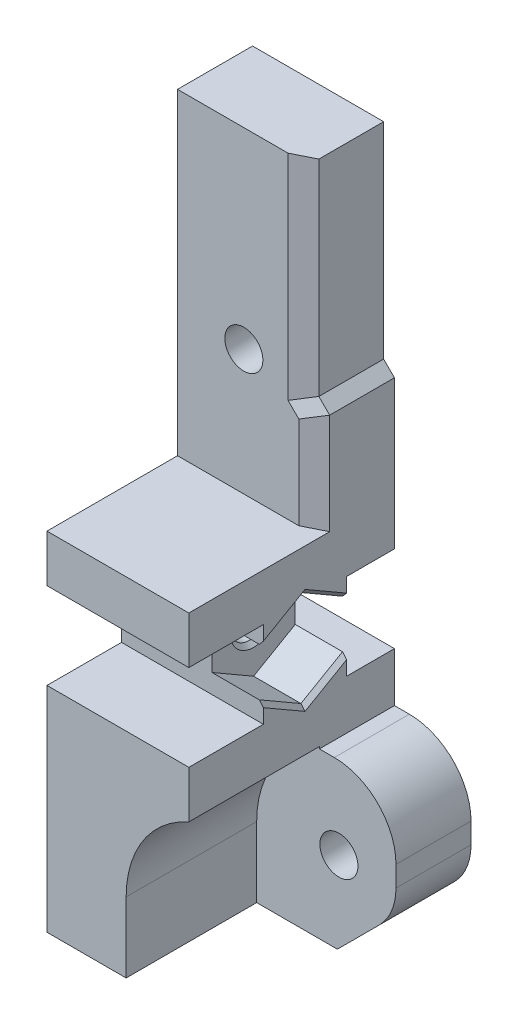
ISO-10303-21;
HEADER;
FILE_DESCRIPTION(('STEP AP214'),'2;1');
FILE_NAME('part.step','',(''),(''),'','','');
FILE_SCHEMA(('AUTOMOTIVE_DESIGN { 1 0 10303 214 1 1 1 1 }'));
ENDSEC;
DATA;
#1=APPLICATION_CONTEXT('core data for automotive mechanical design processes');
#2=APPLICATION_PROTOCOL_DEFINITION('international standard','automotive_design',2000,#1);
#3=PRODUCT_CONTEXT('',#1,'mechanical');
#4=PRODUCT('Part','Part','',(#3));
#5=PRODUCT_RELATED_PRODUCT_CATEGORY('part','',(#4));
#6=PRODUCT_DEFINITION_FORMATION('','',#4);
#7=PRODUCT_DEFINITION_CONTEXT('part definition',#1,'design');
#8=PRODUCT_DEFINITION('design','',#6,#7);
#9=PRODUCT_DEFINITION_SHAPE('','',#8);
#10=(LENGTH_UNIT() NAMED_UNIT(*) SI_UNIT(.MILLI.,.METRE.));
#11=(NAMED_UNIT(*) PLANE_ANGLE_UNIT() SI_UNIT($,.RADIAN.));
#12=(NAMED_UNIT(*) SI_UNIT($,.STERADIAN.) SOLID_ANGLE_UNIT());
#13=UNCERTAINTY_MEASURE_WITH_UNIT(LENGTH_MEASURE(1.E-05),#10,'distance_accuracy_value','');
#14=(GEOMETRIC_REPRESENTATION_CONTEXT(3) GLOBAL_UNCERTAINTY_ASSIGNED_CONTEXT((#13)) GLOBAL_UNIT_ASSIGNED_CONTEXT((#10,
#11,#12)) REPRESENTATION_CONTEXT('',''));
#15=CARTESIAN_POINT('',(0.,0.,0.));
#16=DIRECTION('',(0.,0.,1.));
#17=DIRECTION('',(1.,0.,0.));
#18=AXIS2_PLACEMENT_3D('',#15,#16,#17);
#19=CARTESIAN_POINT('',(13.8,0.,20.));
#20=DIRECTION('',(-1.,0.,0.));
#21=DIRECTION('',(0.,0.,1.));
#22=AXIS2_PLACEMENT_3D('',#19,#20,#21);
#23=PLANE('',#22);
#24=DIRECTION('',(0.,-0.5,0.866025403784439));
#25=VECTOR('',#24,1.);
#26=CARTESIAN_POINT('',(13.8,-2.14685657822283,18.7605117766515));
#27=LINE('',#26,#25);
#28=CARTESIAN_POINT('',(13.8,5.99985119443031,4.65));
#29=VERTEX_POINT('',#28);
#30=CARTESIAN_POINT('',(13.8,3.66158260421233,8.7));
#31=VERTEX_POINT('',#30);
#32=EDGE_CURVE('E509',#29,#31,#27,.T.);
#33=ORIENTED_EDGE('',*,*,#32,.T.);
#34=DIRECTION('',(0.,0.5,0.866025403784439));
#35=VECTOR('',#34,1.);
#36=CARTESIAN_POINT('',(13.8,7.63923048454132,15.5894882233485));
#37=LINE('',#36,#35);
#38=CARTESIAN_POINT('',(13.8,5.99985119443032,12.75));
#39=VERTEX_POINT('',#38);
#40=EDGE_CURVE('E507',#31,#39,#37,.T.);
#41=ORIENTED_EDGE('',*,*,#40,.T.);
#42=DIRECTION('',(0.,-1.,0.));
#43=VECTOR('',#42,1.);
#44=CARTESIAN_POINT('',(13.8,0.,12.75));
#45=LINE('',#44,#43);
#46=CARTESIAN_POINT('',(13.8,4.59999999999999,12.75));
#47=VERTEX_POINT('',#46);
#48=EDGE_CURVE('E623',#39,#47,#45,.T.);
#49=ORIENTED_EDGE('',*,*,#48,.T.);
#50=DIRECTION('',(0.,0.,1.));
#51=VECTOR('',#50,1.);
#52=CARTESIAN_POINT('',(13.8,4.59999999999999,20.));
#53=LINE('',#52,#51);
#54=CARTESIAN_POINT('',(13.8,4.59999999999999,20.));
#55=VERTEX_POINT('',#54);
#56=EDGE_CURVE('E830',#47,#55,#53,.T.);
#57=ORIENTED_EDGE('',*,*,#56,.T.);
#58=DIRECTION('',(0.,1.,0.));
#59=VECTOR('',#58,1.);
#60=CARTESIAN_POINT('',(13.8,0.,20.));
#61=LINE('',#60,#59);
#62=CARTESIAN_POINT('',(13.8,0.,20.));
#63=VERTEX_POINT('',#62);
#64=EDGE_CURVE('E377',#63,#55,#61,.T.);
#65=ORIENTED_EDGE('',*,*,#64,.F.);
#66=DIRECTION('',(0.,0.,-1.));
#67=VECTOR('',#66,1.);
#68=CARTESIAN_POINT('',(13.8,0.,20.));
#69=LINE('',#68,#67);
#70=CARTESIAN_POINT('',(13.8,0.,7.3));
#71=VERTEX_POINT('',#70);
#72=EDGE_CURVE('E440',#63,#71,#69,.T.);
#73=ORIENTED_EDGE('',*,*,#72,.T.);
#74=DIRECTION('',(0.,-1.,0.));
#75=VECTOR('',#74,1.);
#76=CARTESIAN_POINT('',(13.8,-0.200000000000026,7.3));
#77=LINE('',#76,#75);
#78=CARTESIAN_POINT('',(13.8,-0.200000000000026,7.3));
#79=VERTEX_POINT('',#78);
#80=EDGE_CURVE('E356',#71,#79,#77,.T.);
#81=ORIENTED_EDGE('',*,*,#80,.T.);
#82=DIRECTION('',(0.,0.,-1.));
#83=VECTOR('',#82,1.);
#84=CARTESIAN_POINT('',(13.8,-0.200000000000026,7.3));
#85=LINE('',#84,#83);
#86=CARTESIAN_POINT('',(13.8,-0.200000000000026,0.));
#87=VERTEX_POINT('',#86);
#88=EDGE_CURVE('E368',#79,#87,#85,.T.);
#89=ORIENTED_EDGE('',*,*,#88,.T.);
#90=DIRECTION('',(0.,1.,0.));
#91=VECTOR('',#90,1.);
#92=CARTESIAN_POINT('',(13.8,0.,0.));
#93=LINE('',#92,#91);
#94=CARTESIAN_POINT('',(13.8,4.59999999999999,0.));
#95=VERTEX_POINT('',#94);
#96=EDGE_CURVE('E403',#87,#95,#93,.T.);
#97=ORIENTED_EDGE('',*,*,#96,.T.);
#98=DIRECTION('',(0.,0.,1.));
#99=VECTOR('',#98,1.);
#100=CARTESIAN_POINT('',(13.8,4.59999999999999,20.));
#101=LINE('',#100,#99);
#102=CARTESIAN_POINT('',(13.8,4.59999999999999,4.65));
#103=VERTEX_POINT('',#102);
#104=EDGE_CURVE('E647',#95,#103,#101,.T.);
#105=ORIENTED_EDGE('',*,*,#104,.T.);
#106=DIRECTION('',(0.,1.,0.));
#107=VECTOR('',#106,1.);
#108=CARTESIAN_POINT('',(13.8,0.,4.65));
#109=LINE('',#108,#107);
#110=EDGE_CURVE('E422',#103,#29,#109,.T.);
#111=ORIENTED_EDGE('',*,*,#110,.T.);
#112=EDGE_LOOP('',(#33,#41,#49,#57,#65,#73,#81,#89,#97,#105,#111));
#113=FACE_BOUND('',#112,.T.);
#114=ADVANCED_FACE('F33',(#113),#23,.F.);
#115=CARTESIAN_POINT('',(0.,0.,20.));
#116=DIRECTION('',(0.,0.,-1.));
#117=DIRECTION('',(-1.,0.,0.));
#118=AXIS2_PLACEMENT_3D('',#115,#116,#117);
#119=PLANE('',#118);
#120=ORIENTED_EDGE('',*,*,#64,.T.);
#121=DIRECTION('',(-1.,0.,0.));
#122=VECTOR('',#121,1.);
#123=CARTESIAN_POINT('',(0.,4.59999999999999,20.));
#124=LINE('',#123,#122);
#125=CARTESIAN_POINT('',(0.,4.59999999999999,20.));
#126=VERTEX_POINT('',#125);
#127=EDGE_CURVE('E428',#55,#126,#124,.T.);
#128=ORIENTED_EDGE('',*,*,#127,.T.);
#129=DIRECTION('',(0.,-1.,0.));
#130=VECTOR('',#129,1.);
#131=CARTESIAN_POINT('',(0.,0.,20.));
#132=LINE('',#131,#130);
#133=CARTESIAN_POINT('',(0.,-16.2,20.));
#134=VERTEX_POINT('',#133);
#135=EDGE_CURVE('E376',#126,#134,#132,.T.);
#136=ORIENTED_EDGE('',*,*,#135,.T.);
#137=DIRECTION('',(-1.,0.,0.));
#138=VECTOR('',#137,1.);
#139=CARTESIAN_POINT('',(0.,-16.2,20.));
#140=LINE('',#139,#138);
#141=CARTESIAN_POINT('',(7.70000000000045,-16.2,20.));
#142=VERTEX_POINT('',#141);
#143=EDGE_CURVE('E454',#142,#134,#140,.T.);
#144=ORIENTED_EDGE('',*,*,#143,.F.);
#145=DIRECTION('',(0.,-1.,0.));
#146=VECTOR('',#145,1.);
#147=CARTESIAN_POINT('',(7.70000000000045,-16.2,20.));
#148=LINE('',#147,#146);
#149=CARTESIAN_POINT('',(7.70000000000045,-9.37236891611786,20.));
#150=VERTEX_POINT('',#149);
#151=EDGE_CURVE('E767',#150,#142,#148,.T.);
#152=ORIENTED_EDGE('',*,*,#151,.F.);
#153=CARTESIAN_POINT('',(17.9501064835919,-9.37236891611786,20.));
#154=DIRECTION('',(0.,0.,-1.));
#155=DIRECTION('',(-1.,0.,0.));
#156=AXIS2_PLACEMENT_3D('',#153,#154,#155);
#157=CIRCLE('',#156,10.2501064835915);
#158=EDGE_CURVE('E764',#63,#150,#157,.F.);
#159=ORIENTED_EDGE('',*,*,#158,.F.);
#160=EDGE_LOOP('',(#120,#128,#136,#144,#152,#159));
#161=FACE_BOUND('',#160,.T.);
#162=ADVANCED_FACE('F593',(#161),#119,.F.);
#163=CARTESIAN_POINT('',(0.,0.,0.));
#164=DIRECTION('',(0.,0.,-1.));
#165=DIRECTION('',(-1.,0.,0.));
#166=AXIS2_PLACEMENT_3D('',#163,#164,#165);
#167=PLANE('',#166);
#168=DIRECTION('',(1.,0.,0.));
#169=VECTOR('',#168,1.);
#170=CARTESIAN_POINT('',(0.,13.,0.));
#171=LINE('',#170,#169);
#172=CARTESIAN_POINT('',(0.,13.,0.));
#173=VERTEX_POINT('',#172);
#174=CARTESIAN_POINT('',(13.8,13.,0.));
#175=VERTEX_POINT('',#174);
#176=EDGE_CURVE('E418',#173,#175,#171,.T.);
#177=ORIENTED_EDGE('',*,*,#176,.F.);
#178=DIRECTION('',(0.,-1.,0.));
#179=VECTOR('',#178,1.);
#180=CARTESIAN_POINT('',(0.,0.,0.));
#181=LINE('',#180,#179);
#182=CARTESIAN_POINT('',(0.,48.4671572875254,0.));
#183=VERTEX_POINT('',#182);
#184=EDGE_CURVE('E383',#183,#173,#181,.T.);
#185=ORIENTED_EDGE('',*,*,#184,.F.);
#186=DIRECTION('',(1.,0.,0.));
#187=VECTOR('',#186,1.);
#188=CARTESIAN_POINT('',(12.7500000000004,48.4671572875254,0.));
#189=LINE('',#188,#187);
#190=CARTESIAN_POINT('',(12.7500000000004,48.4671572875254,0.));
#191=VERTEX_POINT('',#190);
#192=EDGE_CURVE('E450',#183,#191,#189,.T.);
#193=ORIENTED_EDGE('',*,*,#192,.T.);
#194=DIRECTION('',(0.,-1.,0.));
#195=VECTOR('',#194,1.);
#196=CARTESIAN_POINT('',(12.7500000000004,28.4671572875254,0.));
#197=LINE('',#196,#195);
#198=CARTESIAN_POINT('',(12.7500000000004,28.4671572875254,0.));
#199=VERTEX_POINT('',#198);
#200=EDGE_CURVE('E453',#191,#199,#197,.T.);
#201=ORIENTED_EDGE('',*,*,#200,.T.);
#202=DIRECTION('',(0.707106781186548,-0.707106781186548,0.));
#203=VECTOR('',#202,1.);
#204=CARTESIAN_POINT('',(17.1171572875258,24.1,0.));
#205=LINE('',#204,#203);
#206=CARTESIAN_POINT('',(13.8,27.4171572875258,0.));
#207=VERTEX_POINT('',#206);
#208=EDGE_CURVE('E400',#199,#207,#205,.T.);
#209=ORIENTED_EDGE('',*,*,#208,.T.);
#210=EDGE_CURVE('E386',#175,#207,#93,.T.);
#211=ORIENTED_EDGE('',*,*,#210,.F.);
#212=EDGE_LOOP('',(#177,#185,#193,#201,#209,#211));
#213=FACE_BOUND('',#212,.T.);
#214=DIRECTION('',(0.866025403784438,-0.500000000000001,0.));
#215=VECTOR('',#214,1.);
#216=CARTESIAN_POINT('',(6.45000000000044,34.476537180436,0.));
#217=LINE('',#216,#215);
#218=CARTESIAN_POINT('',(6.45000000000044,34.476537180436,0.));
#219=VERTEX_POINT('',#218);
#220=CARTESIAN_POINT('',(10.5000000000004,32.138268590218,0.));
#221=VERTEX_POINT('',#220);
#222=EDGE_CURVE('E727',#219,#221,#217,.T.);
#223=ORIENTED_EDGE('',*,*,#222,.F.);
#224=DIRECTION('',(0.866025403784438,0.500000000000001,0.));
#225=VECTOR('',#224,1.);
#226=CARTESIAN_POINT('',(2.40000000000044,32.138268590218,0.));
#227=LINE('',#226,#225);
#228=CARTESIAN_POINT('',(2.40000000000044,32.138268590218,0.));
#229=VERTEX_POINT('',#228);
#230=EDGE_CURVE('E711',#229,#219,#227,.T.);
#231=ORIENTED_EDGE('',*,*,#230,.F.);
#232=DIRECTION('',(0.,1.,0.));
#233=VECTOR('',#232,1.);
#234=CARTESIAN_POINT('',(2.40000000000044,27.461731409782,0.));
#235=LINE('',#234,#233);
#236=CARTESIAN_POINT('',(2.40000000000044,27.461731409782,0.));
#237=VERTEX_POINT('',#236);
#238=EDGE_CURVE('E738',#237,#229,#235,.T.);
#239=ORIENTED_EDGE('',*,*,#238,.F.);
#240=DIRECTION('',(-0.866025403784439,0.5,0.));
#241=VECTOR('',#240,1.);
#242=CARTESIAN_POINT('',(6.45000000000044,25.123462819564,0.));
#243=LINE('',#242,#241);
#244=CARTESIAN_POINT('',(6.45000000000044,25.123462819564,0.));
#245=VERTEX_POINT('',#244);
#246=EDGE_CURVE('E735',#245,#237,#243,.T.);
#247=ORIENTED_EDGE('',*,*,#246,.F.);
#248=DIRECTION('',(-0.866025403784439,-0.5,0.));
#249=VECTOR('',#248,1.);
#250=CARTESIAN_POINT('',(10.5000000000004,27.461731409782,0.));
#251=LINE('',#250,#249);
#252=CARTESIAN_POINT('',(10.5000000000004,27.461731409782,0.));
#253=VERTEX_POINT('',#252);
#254=EDGE_CURVE('E732',#253,#245,#251,.T.);
#255=ORIENTED_EDGE('',*,*,#254,.F.);
#256=DIRECTION('',(0.,-1.,0.));
#257=VECTOR('',#256,1.);
#258=CARTESIAN_POINT('',(10.5000000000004,32.138268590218,0.));
#259=LINE('',#258,#257);
#260=EDGE_CURVE('E729',#221,#253,#259,.T.);
#261=ORIENTED_EDGE('',*,*,#260,.F.);
#262=EDGE_LOOP('',(#223,#231,#239,#247,#255,#261));
#263=FACE_BOUND('',#262,.T.);
#264=ADVANCED_FACE('F565',(#213,#263),#167,.T.);
#265=CARTESIAN_POINT('',(15.7000000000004,-8.20000000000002,0.));
#266=DIRECTION('',(0.,0.,1.));
#267=DIRECTION('',(1.,0.,0.));
#268=AXIS2_PLACEMENT_3D('',#265,#266,#267);
#269=CYLINDRICAL_SURFACE('',#268,1.84999999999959);
#270=CARTESIAN_POINT('',(15.7000000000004,-8.20000000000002,7.3));
#271=DIRECTION('',(0.,0.,1.));
#272=DIRECTION('',(1.,0.,0.));
#273=AXIS2_PLACEMENT_3D('',#270,#271,#272);
#274=CIRCLE('',#273,1.84999999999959);
#275=CARTESIAN_POINT('',(17.55,-8.20000000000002,7.3));
#276=VERTEX_POINT('',#275);
#277=EDGE_CURVE('E759',#276,#276,#274,.T.);
#278=ORIENTED_EDGE('',*,*,#277,.T.);
#279=EDGE_LOOP('',(#278));
#280=FACE_BOUND('',#279,.T.);
#281=CARTESIAN_POINT('',(15.7000000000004,-8.20000000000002,4.));
#282=DIRECTION('',(0.,0.,-1.));
#283=DIRECTION('',(-1.,0.,0.));
#284=AXIS2_PLACEMENT_3D('',#281,#282,#283);
#285=CIRCLE('',#284,1.84999999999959);
#286=CARTESIAN_POINT('',(13.8500000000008,-8.20000000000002,4.));
#287=VERTEX_POINT('',#286);
#288=EDGE_CURVE('E414',#287,#287,#285,.F.);
#289=ORIENTED_EDGE('',*,*,#288,.F.);
#290=EDGE_LOOP('',(#289));
#291=FACE_BOUND('',#290,.T.);
#292=ADVANCED_FACE('F981',(#280,#291),#269,.F.);
#293=CARTESIAN_POINT('',(6.45000000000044,29.8,0.));
#294=DIRECTION('',(0.,0.,1.));
#295=DIRECTION('',(1.,0.,0.));
#296=AXIS2_PLACEMENT_3D('',#293,#294,#295);
#297=CYLINDRICAL_SURFACE('',#296,1.85000000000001);
#298=CARTESIAN_POINT('',(6.45000000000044,29.8,7.3));
#299=DIRECTION('',(0.,0.,1.));
#300=DIRECTION('',(1.,0.,0.));
#301=AXIS2_PLACEMENT_3D('',#298,#299,#300);
#302=CIRCLE('',#301,1.85000000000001);
#303=CARTESIAN_POINT('',(8.30000000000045,29.8,7.3));
#304=VERTEX_POINT('',#303);
#305=EDGE_CURVE('E756',#304,#304,#302,.T.);
#306=ORIENTED_EDGE('',*,*,#305,.T.);
#307=EDGE_LOOP('',(#306));
#308=FACE_BOUND('',#307,.T.);
#309=CARTESIAN_POINT('',(6.45000000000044,29.8,4.));
#310=DIRECTION('',(0.,0.,-1.));
#311=DIRECTION('',(-1.,0.,0.));
#312=AXIS2_PLACEMENT_3D('',#309,#310,#311);
#313=CIRCLE('',#312,1.85000000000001);
#314=CARTESIAN_POINT('',(4.60000000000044,29.8,4.));
#315=VERTEX_POINT('',#314);
#316=EDGE_CURVE('E745',#315,#315,#313,.F.);
#317=ORIENTED_EDGE('',*,*,#316,.F.);
#318=EDGE_LOOP('',(#317));
#319=FACE_BOUND('',#318,.T.);
#320=ADVANCED_FACE('F978',(#308,#319),#297,.F.);
#321=CARTESIAN_POINT('',(0.,0.,7.3));
#322=DIRECTION('',(0.,0.,-1.));
#323=DIRECTION('',(-1.,0.,0.));
#324=AXIS2_PLACEMENT_3D('',#321,#322,#323);
#325=PLANE('',#324);
#326=ORIENTED_EDGE('',*,*,#277,.F.);
#327=EDGE_LOOP('',(#326));
#328=FACE_BOUND('',#327,.T.);
#329=DIRECTION('',(0.,-1.,0.));
#330=VECTOR('',#329,1.);
#331=CARTESIAN_POINT('',(21.2500000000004,-0.200000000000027,7.3));
#332=LINE('',#331,#330);
#333=CARTESIAN_POINT('',(21.2500000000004,-6.20000000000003,7.3));
#334=VERTEX_POINT('',#333);
#335=CARTESIAN_POINT('',(21.2500000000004,-8.20000000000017,7.30000000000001));
#336=VERTEX_POINT('',#335);
#337=EDGE_CURVE('E467',#334,#336,#332,.T.);
#338=ORIENTED_EDGE('',*,*,#337,.F.);
#339=CARTESIAN_POINT('',(15.2500000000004,-6.20000000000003,7.3));
#340=DIRECTION('',(0.,0.,-1.));
#341=DIRECTION('',(-1.,0.,0.));
#342=AXIS2_PLACEMENT_3D('',#339,#340,#341);
#343=CIRCLE('',#342,6.);
#344=CARTESIAN_POINT('',(15.2500000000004,-0.200000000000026,7.3));
#345=VERTEX_POINT('',#344);
#346=EDGE_CURVE('E11',#334,#345,#343,.F.);
#347=ORIENTED_EDGE('',*,*,#346,.T.);
#348=DIRECTION('',(1.,0.,0.));
#349=VECTOR('',#348,1.);
#350=CARTESIAN_POINT('',(21.2500000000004,-0.200000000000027,7.3));
#351=LINE('',#350,#349);
#352=EDGE_CURVE('E360',#79,#345,#351,.T.);
#353=ORIENTED_EDGE('',*,*,#352,.F.);
#354=ORIENTED_EDGE('',*,*,#80,.F.);
#355=CARTESIAN_POINT('',(17.9501064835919,-9.37236891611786,7.3));
#356=DIRECTION('',(0.,0.,-1.));
#357=DIRECTION('',(-1.,0.,0.));
#358=AXIS2_PLACEMENT_3D('',#355,#356,#357);
#359=CIRCLE('',#358,10.2501064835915);
#360=CARTESIAN_POINT('',(7.70000000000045,-9.37236891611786,7.3));
#361=VERTEX_POINT('',#360);
#362=EDGE_CURVE('E408',#361,#71,#359,.T.);
#363=ORIENTED_EDGE('',*,*,#362,.F.);
#364=DIRECTION('',(0.,1.,0.));
#365=VECTOR('',#364,1.);
#366=CARTESIAN_POINT('',(7.70000000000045,-16.2,7.3));
#367=LINE('',#366,#365);
#368=CARTESIAN_POINT('',(7.70000000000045,-16.2,7.3));
#369=VERTEX_POINT('',#368);
#370=EDGE_CURVE('E763',#369,#361,#367,.T.);
#371=ORIENTED_EDGE('',*,*,#370,.F.);
#372=DIRECTION('',(-1.,0.,0.));
#373=VECTOR('',#372,1.);
#374=CARTESIAN_POINT('',(21.2500000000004,-16.2,7.3));
#375=LINE('',#374,#373);
#376=CARTESIAN_POINT('',(15.5488852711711,-16.2,7.3));
#377=VERTEX_POINT('',#376);
#378=EDGE_CURVE('E371',#377,#369,#375,.T.);
#379=ORIENTED_EDGE('',*,*,#378,.F.);
#380=DIRECTION('',(0.707106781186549,0.707106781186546,0.));
#381=VECTOR('',#380,1.);
#382=CARTESIAN_POINT('',(15.8744426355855,-15.8744426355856,7.3));
#383=LINE('',#382,#381);
#384=CARTESIAN_POINT('',(19.6244426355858,-12.1244426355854,7.3));
#385=VERTEX_POINT('',#384);
#386=EDGE_CURVE('E337',#377,#385,#383,.T.);
#387=ORIENTED_EDGE('',*,*,#386,.T.);
#388=CARTESIAN_POINT('',(15.7000000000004,-8.20000000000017,7.3));
#389=DIRECTION('',(0.,0.,-1.));
#390=DIRECTION('',(-1.,0.,0.));
#391=AXIS2_PLACEMENT_3D('',#388,#389,#390);
#392=CIRCLE('',#391,5.54999999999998);
#393=EDGE_CURVE('E846',#385,#336,#392,.F.);
#394=ORIENTED_EDGE('',*,*,#393,.T.);
#395=EDGE_LOOP('',(#338,#347,#353,#354,#363,#371,#379,#387,#394));
#396=FACE_BOUND('',#395,.T.);
#397=ADVANCED_FACE('F612',(#328,#396),#325,.F.);
#398=CARTESIAN_POINT('',(0.,0.,20.));
#399=DIRECTION('',(1.,0.,0.));
#400=DIRECTION('',(0.,0.,-1.));
#401=AXIS2_PLACEMENT_3D('',#398,#399,#400);
#402=PLANE('',#401);
#403=CARTESIAN_POINT('',(0.,8.8,8.7));
#404=DIRECTION('',(1.,0.,0.));
#405=DIRECTION('',(0.,0.,-1.));
#406=AXIS2_PLACEMENT_3D('',#403,#404,#405);
#407=CIRCLE('',#406,1.85);
#408=CARTESIAN_POINT('',(0.,8.8,6.85));
#409=VERTEX_POINT('',#408);
#410=EDGE_CURVE('E827',#409,#409,#407,.F.);
#411=ORIENTED_EDGE('',*,*,#410,.F.);
#412=EDGE_LOOP('',(#411));
#413=FACE_BOUND('',#412,.T.);
#414=ORIENTED_EDGE('',*,*,#135,.F.);
#415=DIRECTION('',(0.,0.,1.));
#416=VECTOR('',#415,1.);
#417=CARTESIAN_POINT('',(0.,4.59999999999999,20.));
#418=LINE('',#417,#416);
#419=CARTESIAN_POINT('',(0.,4.59999999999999,12.75));
#420=VERTEX_POINT('',#419);
#421=EDGE_CURVE('E836',#420,#126,#418,.T.);
#422=ORIENTED_EDGE('',*,*,#421,.F.);
#423=DIRECTION('',(0.,-1.,0.));
#424=VECTOR('',#423,1.);
#425=CARTESIAN_POINT('',(0.,4.59999999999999,12.75));
#426=LINE('',#425,#424);
#427=CARTESIAN_POINT('',(0.,13.,12.75));
#428=VERTEX_POINT('',#427);
#429=EDGE_CURVE('E839',#428,#420,#426,.T.);
#430=ORIENTED_EDGE('',*,*,#429,.F.);
#431=DIRECTION('',(0.,0.,-1.));
#432=VECTOR('',#431,1.);
#433=CARTESIAN_POINT('',(0.,13.,20.));
#434=LINE('',#433,#432);
#435=CARTESIAN_POINT('',(0.,13.,20.));
#436=VERTEX_POINT('',#435);
#437=EDGE_CURVE('E842',#436,#428,#434,.T.);
#438=ORIENTED_EDGE('',*,*,#437,.F.);
#439=CARTESIAN_POINT('',(0.,17.6,20.));
#440=VERTEX_POINT('',#439);
#441=EDGE_CURVE('E372',#440,#436,#132,.T.);
#442=ORIENTED_EDGE('',*,*,#441,.F.);
#443=DIRECTION('',(0.,0.,-1.));
#444=VECTOR('',#443,1.);
#445=CARTESIAN_POINT('',(0.,17.6,20.));
#446=LINE('',#445,#444);
#447=CARTESIAN_POINT('',(0.,17.6,7.3));
#448=VERTEX_POINT('',#447);
#449=EDGE_CURVE('E382',#440,#448,#446,.T.);
#450=ORIENTED_EDGE('',*,*,#449,.T.);
#451=DIRECTION('',(0.,1.,0.));
#452=VECTOR('',#451,1.);
#453=CARTESIAN_POINT('',(0.,48.4671572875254,7.3));
#454=LINE('',#453,#452);
#455=CARTESIAN_POINT('',(0.,48.4671572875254,7.3));
#456=VERTEX_POINT('',#455);
#457=EDGE_CURVE('E396',#448,#456,#454,.T.);
#458=ORIENTED_EDGE('',*,*,#457,.T.);
#459=DIRECTION('',(0.,0.,-1.));
#460=VECTOR('',#459,1.);
#461=CARTESIAN_POINT('',(0.,48.4671572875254,7.3));
#462=LINE('',#461,#460);
#463=EDGE_CURVE('E449',#456,#183,#462,.T.);
#464=ORIENTED_EDGE('',*,*,#463,.T.);
#465=ORIENTED_EDGE('',*,*,#184,.T.);
#466=DIRECTION('',(0.,0.,-1.));
#467=VECTOR('',#466,1.);
#468=CARTESIAN_POINT('',(0.,13.,0.));
#469=LINE('',#468,#467);
#470=CARTESIAN_POINT('',(0.,13.,4.65));
#471=VERTEX_POINT('',#470);
#472=EDGE_CURVE('E653',#471,#173,#469,.T.);
#473=ORIENTED_EDGE('',*,*,#472,.F.);
#474=DIRECTION('',(0.,1.,0.));
#475=VECTOR('',#474,1.);
#476=CARTESIAN_POINT('',(0.,13.,4.65));
#477=LINE('',#476,#475);
#478=CARTESIAN_POINT('',(0.,4.59999999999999,4.65));
#479=VERTEX_POINT('',#478);
#480=EDGE_CURVE('E645',#479,#471,#477,.T.);
#481=ORIENTED_EDGE('',*,*,#480,.F.);
#482=DIRECTION('',(0.,0.,1.));
#483=VECTOR('',#482,1.);
#484=CARTESIAN_POINT('',(0.,4.59999999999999,0.));
#485=LINE('',#484,#483);
#486=CARTESIAN_POINT('',(0.,4.59999999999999,0.));
#487=VERTEX_POINT('',#486);
#488=EDGE_CURVE('E790',#487,#479,#485,.T.);
#489=ORIENTED_EDGE('',*,*,#488,.F.);
#490=CARTESIAN_POINT('',(0.,-16.2,0.));
#491=VERTEX_POINT('',#490);
#492=EDGE_CURVE('E367',#487,#491,#181,.T.);
#493=ORIENTED_EDGE('',*,*,#492,.T.);
#494=DIRECTION('',(0.,0.,-1.));
#495=VECTOR('',#494,1.);
#496=CARTESIAN_POINT('',(0.,-16.2,7.3));
#497=LINE('',#496,#495);
#498=EDGE_CURVE('E355',#134,#491,#497,.T.);
#499=ORIENTED_EDGE('',*,*,#498,.F.);
#500=EDGE_LOOP('',(#414,#422,#430,#438,#442,#450,#458,#464,#465,#473,#481,#489,#493,#499));
#501=FACE_BOUND('',#500,.T.);
#502=ADVANCED_FACE('F570',(#413,#501),#402,.F.);
#503=CARTESIAN_POINT('',(13.8,13.,12.75));
#504=VERTEX_POINT('',#503);
#505=CARTESIAN_POINT('',(13.8,11.6001488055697,12.75));
#506=VERTEX_POINT('',#505);
#507=EDGE_CURVE('E616',#504,#506,#45,.T.);
#508=ORIENTED_EDGE('',*,*,#507,.T.);
#509=DIRECTION('',(0.,0.5,-0.866025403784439));
#510=VECTOR('',#509,1.);
#511=CARTESIAN_POINT('',(13.8,5.56076951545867,23.2105117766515));
#512=LINE('',#511,#510);
#513=CARTESIAN_POINT('',(13.8,13.9384173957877,8.7));
#514=VERTEX_POINT('',#513);
#515=EDGE_CURVE('E482',#506,#514,#512,.T.);
#516=ORIENTED_EDGE('',*,*,#515,.T.);
#517=DIRECTION('',(0.,-0.5,-0.866025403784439));
#518=VECTOR('',#517,1.);
#519=CARTESIAN_POINT('',(13.8,15.3468565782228,11.1394882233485));
#520=LINE('',#519,#518);
#521=CARTESIAN_POINT('',(13.8,11.6001488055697,4.65));
#522=VERTEX_POINT('',#521);
#523=EDGE_CURVE('E492',#514,#522,#520,.T.);
#524=ORIENTED_EDGE('',*,*,#523,.T.);
#525=CARTESIAN_POINT('',(13.8,13.,4.65));
#526=VERTEX_POINT('',#525);
#527=EDGE_CURVE('E421',#522,#526,#109,.T.);
#528=ORIENTED_EDGE('',*,*,#527,.T.);
#529=DIRECTION('',(0.,0.,-1.));
#530=VECTOR('',#529,1.);
#531=CARTESIAN_POINT('',(13.8,13.,20.));
#532=LINE('',#531,#530);
#533=EDGE_CURVE('E651',#526,#175,#532,.T.);
#534=ORIENTED_EDGE('',*,*,#533,.T.);
#535=ORIENTED_EDGE('',*,*,#210,.T.);
#536=DIRECTION('',(0.,0.,1.));
#537=VECTOR('',#536,1.);
#538=CARTESIAN_POINT('',(13.8,27.4171572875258,-4.99999999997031E-05));
#539=LINE('',#538,#537);
#540=CARTESIAN_POINT('',(13.8,27.4171572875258,6.29999999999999));
#541=VERTEX_POINT('',#540);
#542=EDGE_CURVE('E561',#207,#541,#539,.T.);
#543=ORIENTED_EDGE('',*,*,#542,.T.);
#544=DIRECTION('',(0.,-1.,0.));
#545=VECTOR('',#544,1.);
#546=CARTESIAN_POINT('',(13.8,17.6,6.29999999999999));
#547=LINE('',#546,#545);
#548=CARTESIAN_POINT('',(13.8,17.6,6.29999999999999));
#549=VERTEX_POINT('',#548);
#550=EDGE_CURVE('E434',#541,#549,#547,.T.);
#551=ORIENTED_EDGE('',*,*,#550,.T.);
#552=DIRECTION('',(0.,0.,-1.));
#553=VECTOR('',#552,1.);
#554=CARTESIAN_POINT('',(13.8,17.6,20.));
#555=LINE('',#554,#553);
#556=CARTESIAN_POINT('',(13.8,17.6,20.));
#557=VERTEX_POINT('',#556);
#558=EDGE_CURVE('E389',#557,#549,#555,.T.);
#559=ORIENTED_EDGE('',*,*,#558,.F.);
#560=CARTESIAN_POINT('',(13.8,13.,20.));
#561=VERTEX_POINT('',#560);
#562=EDGE_CURVE('E375',#561,#557,#61,.T.);
#563=ORIENTED_EDGE('',*,*,#562,.F.);
#564=DIRECTION('',(0.,0.,-1.));
#565=VECTOR('',#564,1.);
#566=CARTESIAN_POINT('',(13.8,13.,20.));
#567=LINE('',#566,#565);
#568=EDGE_CURVE('E620',#561,#504,#567,.T.);
#569=ORIENTED_EDGE('',*,*,#568,.T.);
#570=EDGE_LOOP('',(#508,#516,#524,#528,#534,#535,#543,#551,#559,#563,#569));
#571=FACE_BOUND('',#570,.T.);
#572=ADVANCED_FACE('F596',(#571),#23,.F.);
#573=CARTESIAN_POINT('',(0.,17.6,20.));
#574=DIRECTION('',(0.,-1.,0.));
#575=DIRECTION('',(0.,0.,-1.));
#576=AXIS2_PLACEMENT_3D('',#573,#574,#575);
#577=PLANE('',#576);
#578=ORIENTED_EDGE('',*,*,#558,.T.);
#579=DIRECTION('',(-0.894427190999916,0.,0.447213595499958));
#580=VECTOR('',#579,1.);
#581=CARTESIAN_POINT('',(-2.72,17.6,14.56));
#582=LINE('',#581,#580);
#583=CARTESIAN_POINT('',(11.8,17.6,7.3));
#584=VERTEX_POINT('',#583);
#585=EDGE_CURVE('E520',#549,#584,#582,.T.);
#586=ORIENTED_EDGE('',*,*,#585,.T.);
#587=DIRECTION('',(-1.,0.,0.));
#588=VECTOR('',#587,1.);
#589=CARTESIAN_POINT('',(13.8,17.6,7.3));
#590=LINE('',#589,#588);
#591=EDGE_CURVE('E419',#584,#448,#590,.T.);
#592=ORIENTED_EDGE('',*,*,#591,.T.);
#593=ORIENTED_EDGE('',*,*,#449,.F.);
#594=DIRECTION('',(-1.,0.,0.));
#595=VECTOR('',#594,1.);
#596=CARTESIAN_POINT('',(0.,17.6,20.));
#597=LINE('',#596,#595);
#598=EDGE_CURVE('E380',#557,#440,#597,.T.);
#599=ORIENTED_EDGE('',*,*,#598,.F.);
#600=EDGE_LOOP('',(#578,#586,#592,#593,#599));
#601=FACE_BOUND('',#600,.T.);
#602=ADVANCED_FACE('F606',(#601),#577,.F.);
#603=ORIENTED_EDGE('',*,*,#441,.T.);
#604=DIRECTION('',(1.,0.,0.));
#605=VECTOR('',#604,1.);
#606=CARTESIAN_POINT('',(0.,13.,20.));
#607=LINE('',#606,#605);
#608=EDGE_CURVE('E425',#436,#561,#607,.T.);
#609=ORIENTED_EDGE('',*,*,#608,.T.);
#610=ORIENTED_EDGE('',*,*,#562,.T.);
#611=ORIENTED_EDGE('',*,*,#598,.T.);
#612=EDGE_LOOP('',(#603,#609,#610,#611));
#613=FACE_BOUND('',#612,.T.);
#614=ADVANCED_FACE('F602',(#613),#119,.F.);
#615=DIRECTION('',(1.,0.,0.));
#616=VECTOR('',#615,1.);
#617=CARTESIAN_POINT('',(21.2500000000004,-0.200000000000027,0.));
#618=LINE('',#617,#616);
#619=CARTESIAN_POINT('',(15.2500000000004,-0.200000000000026,0.));
#620=VERTEX_POINT('',#619);
#621=EDGE_CURVE('E362',#87,#620,#618,.T.);
#622=ORIENTED_EDGE('',*,*,#621,.T.);
#623=CARTESIAN_POINT('',(15.2500000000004,-6.20000000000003,0.));
#624=DIRECTION('',(0.,0.,-1.));
#625=DIRECTION('',(-1.,0.,0.));
#626=AXIS2_PLACEMENT_3D('',#623,#624,#625);
#627=CIRCLE('',#626,6.);
#628=CARTESIAN_POINT('',(21.2500000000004,-6.20000000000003,0.));
#629=VERTEX_POINT('',#628);
#630=EDGE_CURVE('E55',#620,#629,#627,.T.);
#631=ORIENTED_EDGE('',*,*,#630,.T.);
#632=DIRECTION('',(0.,-1.,0.));
#633=VECTOR('',#632,1.);
#634=CARTESIAN_POINT('',(21.2500000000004,-0.200000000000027,0.));
#635=LINE('',#634,#633);
#636=CARTESIAN_POINT('',(21.2500000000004,-8.20000000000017,0.));
#637=VERTEX_POINT('',#636);
#638=EDGE_CURVE('E357',#629,#637,#635,.T.);
#639=ORIENTED_EDGE('',*,*,#638,.T.);
#640=CARTESIAN_POINT('',(15.7000000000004,-8.20000000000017,0.));
#641=DIRECTION('',(0.,0.,1.));
#642=DIRECTION('',(-1.,0.,0.));
#643=AXIS2_PLACEMENT_3D('',#640,#641,#642);
#644=CIRCLE('',#643,5.54999999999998);
#645=CARTESIAN_POINT('',(19.6244426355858,-12.1244426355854,0.));
#646=VERTEX_POINT('',#645);
#647=EDGE_CURVE('E349',#646,#637,#644,.T.);
#648=ORIENTED_EDGE('',*,*,#647,.F.);
#649=DIRECTION('',(0.707106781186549,0.707106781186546,0.));
#650=VECTOR('',#649,1.);
#651=CARTESIAN_POINT('',(19.6244426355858,-12.1244426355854,0.));
#652=LINE('',#651,#650);
#653=CARTESIAN_POINT('',(15.5488852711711,-16.2,0.));
#654=VERTEX_POINT('',#653);
#655=EDGE_CURVE('E334',#654,#646,#652,.T.);
#656=ORIENTED_EDGE('',*,*,#655,.F.);
#657=DIRECTION('',(-1.,0.,0.));
#658=VECTOR('',#657,1.);
#659=CARTESIAN_POINT('',(21.2500000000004,-16.2,0.));
#660=LINE('',#659,#658);
#661=EDGE_CURVE('E346',#654,#491,#660,.T.);
#662=ORIENTED_EDGE('',*,*,#661,.T.);
#663=ORIENTED_EDGE('',*,*,#492,.F.);
#664=DIRECTION('',(-1.,0.,0.));
#665=VECTOR('',#664,1.);
#666=CARTESIAN_POINT('',(0.,4.59999999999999,0.));
#667=LINE('',#666,#665);
#668=EDGE_CURVE('E416',#95,#487,#667,.T.);
#669=ORIENTED_EDGE('',*,*,#668,.F.);
#670=ORIENTED_EDGE('',*,*,#96,.F.);
#671=EDGE_LOOP('',(#622,#631,#639,#648,#656,#662,#663,#669,#670));
#672=FACE_BOUND('',#671,.T.);
#673=DIRECTION('',(-0.866025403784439,-0.5,0.));
#674=VECTOR('',#673,1.);
#675=CARTESIAN_POINT('',(19.7500000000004,-10.538268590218,0.));
#676=LINE('',#675,#674);
#677=CARTESIAN_POINT('',(19.7500000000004,-10.538268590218,0.));
#678=VERTEX_POINT('',#677);
#679=CARTESIAN_POINT('',(15.7000000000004,-12.876537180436,0.));
#680=VERTEX_POINT('',#679);
#681=EDGE_CURVE('E659',#678,#680,#676,.T.);
#682=ORIENTED_EDGE('',*,*,#681,.F.);
#683=DIRECTION('',(0.,-1.,0.));
#684=VECTOR('',#683,1.);
#685=CARTESIAN_POINT('',(19.7500000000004,-5.86173140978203,0.));
#686=LINE('',#685,#684);
#687=CARTESIAN_POINT('',(19.7500000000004,-5.86173140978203,0.));
#688=VERTEX_POINT('',#687);
#689=EDGE_CURVE('E664',#688,#678,#686,.T.);
#690=ORIENTED_EDGE('',*,*,#689,.F.);
#691=DIRECTION('',(0.866025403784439,-0.5,0.));
#692=VECTOR('',#691,1.);
#693=CARTESIAN_POINT('',(15.7000000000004,-3.52346281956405,0.));
#694=LINE('',#693,#692);
#695=CARTESIAN_POINT('',(15.7000000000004,-3.52346281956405,0.));
#696=VERTEX_POINT('',#695);
#697=EDGE_CURVE('E690',#696,#688,#694,.T.);
#698=ORIENTED_EDGE('',*,*,#697,.F.);
#699=DIRECTION('',(0.866025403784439,0.5,0.));
#700=VECTOR('',#699,1.);
#701=CARTESIAN_POINT('',(11.6500000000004,-5.86173140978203,0.));
#702=LINE('',#701,#700);
#703=CARTESIAN_POINT('',(11.6500000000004,-5.86173140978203,0.));
#704=VERTEX_POINT('',#703);
#705=EDGE_CURVE('E687',#704,#696,#702,.T.);
#706=ORIENTED_EDGE('',*,*,#705,.F.);
#707=DIRECTION('',(0.,1.,0.));
#708=VECTOR('',#707,1.);
#709=CARTESIAN_POINT('',(11.6500000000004,-10.538268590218,0.));
#710=LINE('',#709,#708);
#711=CARTESIAN_POINT('',(11.6500000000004,-10.538268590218,0.));
#712=VERTEX_POINT('',#711);
#713=EDGE_CURVE('E684',#712,#704,#710,.T.);
#714=ORIENTED_EDGE('',*,*,#713,.F.);
#715=DIRECTION('',(-0.866025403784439,0.5,0.));
#716=VECTOR('',#715,1.);
#717=CARTESIAN_POINT('',(15.7000000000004,-12.876537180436,0.));
#718=LINE('',#717,#716);
#719=EDGE_CURVE('E681',#680,#712,#718,.T.);
#720=ORIENTED_EDGE('',*,*,#719,.F.);
#721=EDGE_LOOP('',(#682,#690,#698,#706,#714,#720));
#722=FACE_BOUND('',#721,.T.);
#723=ADVANCED_FACE('F343',(#672,#722),#167,.T.);
#724=CARTESIAN_POINT('',(21.2500000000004,-16.2,7.3));
#725=DIRECTION('',(0.,-1.,0.));
#726=DIRECTION('',(0.,0.,-1.));
#727=AXIS2_PLACEMENT_3D('',#724,#725,#726);
#728=PLANE('',#727);
#729=DIRECTION('',(0.,0.,-1.));
#730=VECTOR('',#729,1.);
#731=CARTESIAN_POINT('',(15.5488852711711,-16.2,20.000025));
#732=LINE('',#731,#730);
#733=EDGE_CURVE('E330',#377,#654,#732,.T.);
#734=ORIENTED_EDGE('',*,*,#733,.F.);
#735=ORIENTED_EDGE('',*,*,#378,.T.);
#736=DIRECTION('',(0.,0.,-1.));
#737=VECTOR('',#736,1.);
#738=CARTESIAN_POINT('',(7.70000000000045,-16.2,41.2809774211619));
#739=LINE('',#738,#737);
#740=EDGE_CURVE('E445',#142,#369,#739,.T.);
#741=ORIENTED_EDGE('',*,*,#740,.F.);
#742=ORIENTED_EDGE('',*,*,#143,.T.);
#743=ORIENTED_EDGE('',*,*,#498,.T.);
#744=ORIENTED_EDGE('',*,*,#661,.F.);
#745=EDGE_LOOP('',(#734,#735,#741,#742,#743,#744));
#746=FACE_BOUND('',#745,.T.);
#747=ADVANCED_FACE('F352',(#746),#728,.T.);
#748=CARTESIAN_POINT('',(21.2500000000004,-0.200000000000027,7.3));
#749=DIRECTION('',(1.,0.,0.));
#750=DIRECTION('',(0.,0.,-1.));
#751=AXIS2_PLACEMENT_3D('',#748,#749,#750);
#752=PLANE('',#751);
#753=ORIENTED_EDGE('',*,*,#638,.F.);
#754=DIRECTION('',(0.,0.,-1.));
#755=VECTOR('',#754,1.);
#756=CARTESIAN_POINT('',(21.2500000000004,-6.20000000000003,7.3));
#757=LINE('',#756,#755);
#758=EDGE_CURVE('E41',#629,#334,#757,.F.);
#759=ORIENTED_EDGE('',*,*,#758,.T.);
#760=ORIENTED_EDGE('',*,*,#337,.T.);
#761=DIRECTION('',(0.,0.,-1.));
#762=VECTOR('',#761,1.);
#763=CARTESIAN_POINT('',(21.2500000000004,-8.20000000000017,20.000025));
#764=LINE('',#763,#762);
#765=EDGE_CURVE('E431',#637,#336,#764,.F.);
#766=ORIENTED_EDGE('',*,*,#765,.F.);
#767=EDGE_LOOP('',(#753,#759,#760,#766));
#768=FACE_BOUND('',#767,.T.);
#769=ADVANCED_FACE('F852',(#768),#752,.T.);
#770=CARTESIAN_POINT('',(21.2500000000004,-0.200000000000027,7.3));
#771=DIRECTION('',(0.,1.,0.));
#772=DIRECTION('',(-1.,0.,0.));
#773=AXIS2_PLACEMENT_3D('',#770,#771,#772);
#774=PLANE('',#773);
#775=ORIENTED_EDGE('',*,*,#352,.T.);
#776=DIRECTION('',(0.,0.,-1.));
#777=VECTOR('',#776,1.);
#778=CARTESIAN_POINT('',(15.2500000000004,-0.200000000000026,7.3));
#779=LINE('',#778,#777);
#780=EDGE_CURVE('E476',#345,#620,#779,.T.);
#781=ORIENTED_EDGE('',*,*,#780,.T.);
#782=ORIENTED_EDGE('',*,*,#621,.F.);
#783=ORIENTED_EDGE('',*,*,#88,.F.);
#784=EDGE_LOOP('',(#775,#781,#782,#783));
#785=FACE_BOUND('',#784,.T.);
#786=ADVANCED_FACE('F473',(#785),#774,.T.);
#787=CARTESIAN_POINT('',(17.1171572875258,24.1,7.3));
#788=DIRECTION('',(0.707106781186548,0.707106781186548,0.));
#789=DIRECTION('',(-0.707106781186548,0.707106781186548,0.));
#790=AXIS2_PLACEMENT_3D('',#787,#788,#789);
#791=PLANE('',#790);
#792=DIRECTION('',(0.,0.,-1.));
#793=VECTOR('',#792,1.);
#794=CARTESIAN_POINT('',(12.7500000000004,28.4671572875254,7.3));
#795=LINE('',#794,#793);
#796=CARTESIAN_POINT('',(12.7500000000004,28.4671572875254,6.29999999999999));
#797=VERTEX_POINT('',#796);
#798=EDGE_CURVE('E459',#797,#199,#795,.T.);
#799=ORIENTED_EDGE('',*,*,#798,.F.);
#800=DIRECTION('',(0.707106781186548,-0.707106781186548,0.));
#801=VECTOR('',#800,1.);
#802=CARTESIAN_POINT('',(17.1171572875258,24.1,6.29999999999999));
#803=LINE('',#802,#801);
#804=EDGE_CURVE('E531',#797,#541,#803,.T.);
#805=ORIENTED_EDGE('',*,*,#804,.T.);
#806=ORIENTED_EDGE('',*,*,#542,.F.);
#807=ORIENTED_EDGE('',*,*,#208,.F.);
#808=EDGE_LOOP('',(#799,#805,#806,#807));
#809=FACE_BOUND('',#808,.T.);
#810=ADVANCED_FACE('F558',(#809),#791,.T.);
#811=CARTESIAN_POINT('',(12.7500000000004,28.4671572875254,7.3));
#812=DIRECTION('',(1.,0.,0.));
#813=DIRECTION('',(0.,0.,-1.));
#814=AXIS2_PLACEMENT_3D('',#811,#812,#813);
#815=PLANE('',#814);
#816=DIRECTION('',(0.,0.,-1.));
#817=VECTOR('',#816,1.);
#818=CARTESIAN_POINT('',(12.7500000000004,48.4671572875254,7.3));
#819=LINE('',#818,#817);
#820=CARTESIAN_POINT('',(12.7500000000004,48.4671572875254,6.29999999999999));
#821=VERTEX_POINT('',#820);
#822=EDGE_CURVE('E461',#821,#191,#819,.T.);
#823=ORIENTED_EDGE('',*,*,#822,.F.);
#824=DIRECTION('',(0.,-1.,0.));
#825=VECTOR('',#824,1.);
#826=CARTESIAN_POINT('',(12.7500000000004,28.4671572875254,6.29999999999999));
#827=LINE('',#826,#825);
#828=EDGE_CURVE('E529',#821,#797,#827,.T.);
#829=ORIENTED_EDGE('',*,*,#828,.T.);
#830=ORIENTED_EDGE('',*,*,#798,.T.);
#831=ORIENTED_EDGE('',*,*,#200,.F.);
#832=EDGE_LOOP('',(#823,#829,#830,#831));
#833=FACE_BOUND('',#832,.T.);
#834=ADVANCED_FACE('F554',(#833),#815,.T.);
#835=CARTESIAN_POINT('',(12.7500000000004,48.4671572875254,7.3));
#836=DIRECTION('',(0.,1.,0.));
#837=DIRECTION('',(0.,0.,1.));
#838=AXIS2_PLACEMENT_3D('',#835,#836,#837);
#839=PLANE('',#838);
#840=DIRECTION('',(1.,0.,0.));
#841=VECTOR('',#840,1.);
#842=CARTESIAN_POINT('',(12.7500000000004,48.4671572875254,7.3));
#843=LINE('',#842,#841);
#844=CARTESIAN_POINT('',(10.7500000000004,48.4671572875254,7.3));
#845=VERTEX_POINT('',#844);
#846=EDGE_CURVE('E399',#456,#845,#843,.T.);
#847=ORIENTED_EDGE('',*,*,#846,.T.);
#848=DIRECTION('',(-0.894427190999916,0.,0.447213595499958));
#849=VECTOR('',#848,1.);
#850=CARTESIAN_POINT('',(12.3500000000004,48.4671572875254,6.49999999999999));
#851=LINE('',#850,#849);
#852=EDGE_CURVE('E527',#845,#821,#851,.F.);
#853=ORIENTED_EDGE('',*,*,#852,.T.);
#854=ORIENTED_EDGE('',*,*,#822,.T.);
#855=ORIENTED_EDGE('',*,*,#192,.F.);
#856=ORIENTED_EDGE('',*,*,#463,.F.);
#857=EDGE_LOOP('',(#847,#853,#854,#855,#856));
#858=FACE_BOUND('',#857,.T.);
#859=ADVANCED_FACE('F546',(#858),#839,.T.);
#860=CARTESIAN_POINT('',(0.,0.,7.3));
#861=DIRECTION('',(0.,0.,1.));
#862=DIRECTION('',(1.,0.,0.));
#863=AXIS2_PLACEMENT_3D('',#860,#861,#862);
#864=PLANE('',#863);
#865=ORIENTED_EDGE('',*,*,#305,.F.);
#866=EDGE_LOOP('',(#865));
#867=FACE_BOUND('',#866,.T.);
#868=ORIENTED_EDGE('',*,*,#591,.F.);
#869=DIRECTION('',(0.,1.,0.));
#870=VECTOR('',#869,1.);
#871=CARTESIAN_POINT('',(11.8,27.4171572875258,7.3));
#872=LINE('',#871,#870);
#873=CARTESIAN_POINT('',(11.8,26.5887301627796,7.3));
#874=VERTEX_POINT('',#873);
#875=EDGE_CURVE('E533',#584,#874,#872,.T.);
#876=ORIENTED_EDGE('',*,*,#875,.T.);
#877=DIRECTION('',(-0.707106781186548,0.707106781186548,0.));
#878=VECTOR('',#877,1.);
#879=CARTESIAN_POINT('',(19.1943650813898,19.1943650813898,7.3));
#880=LINE('',#879,#878);
#881=CARTESIAN_POINT('',(10.7500000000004,27.6387301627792,7.3));
#882=VERTEX_POINT('',#881);
#883=EDGE_CURVE('E534',#874,#882,#880,.T.);
#884=ORIENTED_EDGE('',*,*,#883,.T.);
#885=DIRECTION('',(0.,1.,0.));
#886=VECTOR('',#885,1.);
#887=CARTESIAN_POINT('',(10.7500000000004,0.,7.3));
#888=LINE('',#887,#886);
#889=EDGE_CURVE('E437',#882,#845,#888,.T.);
#890=ORIENTED_EDGE('',*,*,#889,.T.);
#891=ORIENTED_EDGE('',*,*,#846,.F.);
#892=ORIENTED_EDGE('',*,*,#457,.F.);
#893=EDGE_LOOP('',(#868,#876,#884,#890,#891,#892));
#894=FACE_BOUND('',#893,.T.);
#895=ADVANCED_FACE('F540',(#867,#894),#864,.T.);
#896=CARTESIAN_POINT('',(17.9501064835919,-9.37236891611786,41.2809774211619));
#897=DIRECTION('',(0.,0.,-1.));
#898=DIRECTION('',(-1.,0.,0.));
#899=AXIS2_PLACEMENT_3D('',#896,#897,#898);
#900=CYLINDRICAL_SURFACE('',#899,10.2501064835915);
#901=ORIENTED_EDGE('',*,*,#72,.F.);
#902=ORIENTED_EDGE('',*,*,#158,.T.);
#903=DIRECTION('',(0.,0.,-1.));
#904=VECTOR('',#903,1.);
#905=CARTESIAN_POINT('',(7.70000000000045,-9.37236891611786,41.2809774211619));
#906=LINE('',#905,#904);
#907=EDGE_CURVE('E772',#150,#361,#906,.T.);
#908=ORIENTED_EDGE('',*,*,#907,.T.);
#909=ORIENTED_EDGE('',*,*,#362,.T.);
#910=EDGE_LOOP('',(#901,#902,#908,#909));
#911=FACE_BOUND('',#910,.T.);
#912=ADVANCED_FACE('F779',(#911),#900,.F.);
#913=CARTESIAN_POINT('',(7.70000000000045,-16.2,41.2809774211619));
#914=DIRECTION('',(-1.,0.,0.));
#915=DIRECTION('',(0.,0.,1.));
#916=AXIS2_PLACEMENT_3D('',#913,#914,#915);
#917=PLANE('',#916);
#918=ORIENTED_EDGE('',*,*,#907,.F.);
#919=ORIENTED_EDGE('',*,*,#151,.T.);
#920=ORIENTED_EDGE('',*,*,#740,.T.);
#921=ORIENTED_EDGE('',*,*,#370,.T.);
#922=EDGE_LOOP('',(#918,#919,#920,#921));
#923=FACE_BOUND('',#922,.T.);
#924=ADVANCED_FACE('F954',(#923),#917,.F.);
#925=CARTESIAN_POINT('',(0.,0.,4.));
#926=DIRECTION('',(0.,0.,-1.));
#927=DIRECTION('',(-1.,0.,0.));
#928=AXIS2_PLACEMENT_3D('',#925,#926,#927);
#929=PLANE('',#928);
#930=DIRECTION('',(0.866025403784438,-0.500000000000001,0.));
#931=VECTOR('',#930,1.);
#932=CARTESIAN_POINT('',(6.45000000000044,34.476537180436,4.));
#933=LINE('',#932,#931);
#934=CARTESIAN_POINT('',(6.45000000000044,34.476537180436,4.));
#935=VERTEX_POINT('',#934);
#936=CARTESIAN_POINT('',(10.5000000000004,32.138268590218,4.));
#937=VERTEX_POINT('',#936);
#938=EDGE_CURVE('E707',#935,#937,#933,.T.);
#939=ORIENTED_EDGE('',*,*,#938,.T.);
#940=DIRECTION('',(0.,-1.,0.));
#941=VECTOR('',#940,1.);
#942=CARTESIAN_POINT('',(10.5000000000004,32.138268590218,4.));
#943=LINE('',#942,#941);
#944=CARTESIAN_POINT('',(10.5000000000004,27.461731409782,4.));
#945=VERTEX_POINT('',#944);
#946=EDGE_CURVE('E710',#937,#945,#943,.T.);
#947=ORIENTED_EDGE('',*,*,#946,.T.);
#948=DIRECTION('',(-0.866025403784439,-0.5,0.));
#949=VECTOR('',#948,1.);
#950=CARTESIAN_POINT('',(10.5000000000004,27.461731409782,4.));
#951=LINE('',#950,#949);
#952=CARTESIAN_POINT('',(6.45000000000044,25.123462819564,4.));
#953=VERTEX_POINT('',#952);
#954=EDGE_CURVE('E714',#945,#953,#951,.T.);
#955=ORIENTED_EDGE('',*,*,#954,.T.);
#956=DIRECTION('',(-0.866025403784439,0.5,0.));
#957=VECTOR('',#956,1.);
#958=CARTESIAN_POINT('',(6.45000000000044,25.123462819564,4.));
#959=LINE('',#958,#957);
#960=CARTESIAN_POINT('',(2.40000000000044,27.461731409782,4.));
#961=VERTEX_POINT('',#960);
#962=EDGE_CURVE('E717',#953,#961,#959,.T.);
#963=ORIENTED_EDGE('',*,*,#962,.T.);
#964=DIRECTION('',(0.,1.,0.));
#965=VECTOR('',#964,1.);
#966=CARTESIAN_POINT('',(2.40000000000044,27.461731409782,4.));
#967=LINE('',#966,#965);
#968=CARTESIAN_POINT('',(2.40000000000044,32.138268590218,4.));
#969=VERTEX_POINT('',#968);
#970=EDGE_CURVE('E720',#961,#969,#967,.T.);
#971=ORIENTED_EDGE('',*,*,#970,.T.);
#972=DIRECTION('',(0.866025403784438,0.500000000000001,0.));
#973=VECTOR('',#972,1.);
#974=CARTESIAN_POINT('',(2.40000000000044,32.138268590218,4.));
#975=LINE('',#974,#973);
#976=EDGE_CURVE('E723',#969,#935,#975,.T.);
#977=ORIENTED_EDGE('',*,*,#976,.T.);
#978=EDGE_LOOP('',(#939,#947,#955,#963,#971,#977));
#979=FACE_BOUND('',#978,.T.);
#980=ORIENTED_EDGE('',*,*,#316,.T.);
#981=EDGE_LOOP('',(#980));
#982=FACE_BOUND('',#981,.T.);
#983=ADVANCED_FACE('F950',(#979,#982),#929,.T.);
#984=CARTESIAN_POINT('',(6.45000000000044,34.476537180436,4.));
#985=DIRECTION('',(0.500000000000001,0.866025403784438,0.));
#986=DIRECTION('',(-0.866025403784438,0.500000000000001,0.));
#987=AXIS2_PLACEMENT_3D('',#984,#985,#986);
#988=PLANE('',#987);
#989=ORIENTED_EDGE('',*,*,#222,.T.);
#990=DIRECTION('',(0.,0.,-1.));
#991=VECTOR('',#990,1.);
#992=CARTESIAN_POINT('',(10.5000000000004,32.138268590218,4.));
#993=LINE('',#992,#991);
#994=EDGE_CURVE('E726',#937,#221,#993,.T.);
#995=ORIENTED_EDGE('',*,*,#994,.F.);
#996=ORIENTED_EDGE('',*,*,#938,.F.);
#997=DIRECTION('',(0.,0.,-1.));
#998=VECTOR('',#997,1.);
#999=CARTESIAN_POINT('',(6.45000000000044,34.476537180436,4.));
#1000=LINE('',#999,#998);
#1001=EDGE_CURVE('E743',#935,#219,#1000,.T.);
#1002=ORIENTED_EDGE('',*,*,#1001,.T.);
#1003=EDGE_LOOP('',(#989,#995,#996,#1002));
#1004=FACE_BOUND('',#1003,.T.);
#1005=ADVANCED_FACE('F953',(#1004),#988,.F.);
#1006=CARTESIAN_POINT('',(2.40000000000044,32.138268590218,4.));
#1007=DIRECTION('',(-0.500000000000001,0.866025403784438,0.));
#1008=DIRECTION('',(-0.866025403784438,-0.500000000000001,0.));
#1009=AXIS2_PLACEMENT_3D('',#1006,#1007,#1008);
#1010=PLANE('',#1009);
#1011=ORIENTED_EDGE('',*,*,#230,.T.);
#1012=ORIENTED_EDGE('',*,*,#1001,.F.);
#1013=ORIENTED_EDGE('',*,*,#976,.F.);
#1014=DIRECTION('',(0.,0.,-1.));
#1015=VECTOR('',#1014,1.);
#1016=CARTESIAN_POINT('',(2.40000000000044,32.138268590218,4.));
#1017=LINE('',#1016,#1015);
#1018=EDGE_CURVE('E746',#969,#229,#1017,.T.);
#1019=ORIENTED_EDGE('',*,*,#1018,.T.);
#1020=EDGE_LOOP('',(#1011,#1012,#1013,#1019));
#1021=FACE_BOUND('',#1020,.T.);
#1022=ADVANCED_FACE('F956',(#1021),#1010,.F.);
#1023=CARTESIAN_POINT('',(2.40000000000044,27.461731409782,4.));
#1024=DIRECTION('',(-1.,0.,0.));
#1025=DIRECTION('',(0.,-1.,0.));
#1026=AXIS2_PLACEMENT_3D('',#1023,#1024,#1025);
#1027=PLANE('',#1026);
#1028=ORIENTED_EDGE('',*,*,#238,.T.);
#1029=ORIENTED_EDGE('',*,*,#1018,.F.);
#1030=ORIENTED_EDGE('',*,*,#970,.F.);
#1031=DIRECTION('',(0.,0.,-1.));
#1032=VECTOR('',#1031,1.);
#1033=CARTESIAN_POINT('',(2.40000000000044,27.461731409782,4.));
#1034=LINE('',#1033,#1032);
#1035=EDGE_CURVE('E748',#961,#237,#1034,.T.);
#1036=ORIENTED_EDGE('',*,*,#1035,.T.);
#1037=EDGE_LOOP('',(#1028,#1029,#1030,#1036));
#1038=FACE_BOUND('',#1037,.T.);
#1039=ADVANCED_FACE('F959',(#1038),#1027,.F.);
#1040=CARTESIAN_POINT('',(6.45000000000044,25.123462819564,4.));
#1041=DIRECTION('',(-0.5,-0.866025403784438,0.));
#1042=DIRECTION('',(0.866025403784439,-0.5,0.));
#1043=AXIS2_PLACEMENT_3D('',#1040,#1041,#1042);
#1044=PLANE('',#1043);
#1045=ORIENTED_EDGE('',*,*,#246,.T.);
#1046=ORIENTED_EDGE('',*,*,#1035,.F.);
#1047=ORIENTED_EDGE('',*,*,#962,.F.);
#1048=DIRECTION('',(0.,0.,-1.));
#1049=VECTOR('',#1048,1.);
#1050=CARTESIAN_POINT('',(6.45000000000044,25.123462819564,4.));
#1051=LINE('',#1050,#1049);
#1052=EDGE_CURVE('E750',#953,#245,#1051,.T.);
#1053=ORIENTED_EDGE('',*,*,#1052,.T.);
#1054=EDGE_LOOP('',(#1045,#1046,#1047,#1053));
#1055=FACE_BOUND('',#1054,.T.);
#1056=ADVANCED_FACE('F963',(#1055),#1044,.F.);
#1057=CARTESIAN_POINT('',(10.5000000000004,27.461731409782,4.));
#1058=DIRECTION('',(0.5,-0.866025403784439,0.));
#1059=DIRECTION('',(0.866025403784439,0.5,0.));
#1060=AXIS2_PLACEMENT_3D('',#1057,#1058,#1059);
#1061=PLANE('',#1060);
#1062=ORIENTED_EDGE('',*,*,#254,.T.);
#1063=ORIENTED_EDGE('',*,*,#1052,.F.);
#1064=ORIENTED_EDGE('',*,*,#954,.F.);
#1065=DIRECTION('',(0.,0.,-1.));
#1066=VECTOR('',#1065,1.);
#1067=CARTESIAN_POINT('',(10.5000000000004,27.461731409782,4.));
#1068=LINE('',#1067,#1066);
#1069=EDGE_CURVE('E752',#945,#253,#1068,.T.);
#1070=ORIENTED_EDGE('',*,*,#1069,.T.);
#1071=EDGE_LOOP('',(#1062,#1063,#1064,#1070));
#1072=FACE_BOUND('',#1071,.T.);
#1073=ADVANCED_FACE('F967',(#1072),#1061,.F.);
#1074=CARTESIAN_POINT('',(10.5000000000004,32.138268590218,4.));
#1075=DIRECTION('',(1.,0.,0.));
#1076=DIRECTION('',(0.,1.,0.));
#1077=AXIS2_PLACEMENT_3D('',#1074,#1075,#1076);
#1078=PLANE('',#1077);
#1079=ORIENTED_EDGE('',*,*,#260,.T.);
#1080=ORIENTED_EDGE('',*,*,#1069,.F.);
#1081=ORIENTED_EDGE('',*,*,#946,.F.);
#1082=ORIENTED_EDGE('',*,*,#994,.T.);
#1083=EDGE_LOOP('',(#1079,#1080,#1081,#1082));
#1084=FACE_BOUND('',#1083,.T.);
#1085=ADVANCED_FACE('F926',(#1084),#1078,.F.);
#1086=CARTESIAN_POINT('',(0.,0.,4.));
#1087=DIRECTION('',(0.,0.,-1.));
#1088=DIRECTION('',(-1.,0.,0.));
#1089=AXIS2_PLACEMENT_3D('',#1086,#1087,#1088);
#1090=PLANE('',#1089);
#1091=DIRECTION('',(-0.866025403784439,-0.5,0.));
#1092=VECTOR('',#1091,1.);
#1093=CARTESIAN_POINT('',(19.7500000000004,-10.538268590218,4.));
#1094=LINE('',#1093,#1092);
#1095=CARTESIAN_POINT('',(19.7500000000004,-10.538268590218,4.));
#1096=VERTEX_POINT('',#1095);
#1097=CARTESIAN_POINT('',(15.7000000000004,-12.876537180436,4.));
#1098=VERTEX_POINT('',#1097);
#1099=EDGE_CURVE('E660',#1096,#1098,#1094,.T.);
#1100=ORIENTED_EDGE('',*,*,#1099,.T.);
#1101=DIRECTION('',(-0.866025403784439,0.5,0.));
#1102=VECTOR('',#1101,1.);
#1103=CARTESIAN_POINT('',(15.7000000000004,-12.876537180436,4.));
#1104=LINE('',#1103,#1102);
#1105=CARTESIAN_POINT('',(11.6500000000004,-10.538268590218,4.));
#1106=VERTEX_POINT('',#1105);
#1107=EDGE_CURVE('E663',#1098,#1106,#1104,.T.);
#1108=ORIENTED_EDGE('',*,*,#1107,.T.);
#1109=DIRECTION('',(0.,1.,0.));
#1110=VECTOR('',#1109,1.);
#1111=CARTESIAN_POINT('',(11.6500000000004,-10.538268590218,4.));
#1112=LINE('',#1111,#1110);
#1113=CARTESIAN_POINT('',(11.6500000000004,-5.86173140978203,4.));
#1114=VERTEX_POINT('',#1113);
#1115=EDGE_CURVE('E667',#1106,#1114,#1112,.T.);
#1116=ORIENTED_EDGE('',*,*,#1115,.T.);
#1117=DIRECTION('',(0.866025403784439,0.5,0.));
#1118=VECTOR('',#1117,1.);
#1119=CARTESIAN_POINT('',(11.6500000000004,-5.86173140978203,4.));
#1120=LINE('',#1119,#1118);
#1121=CARTESIAN_POINT('',(15.7000000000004,-3.52346281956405,4.));
#1122=VERTEX_POINT('',#1121);
#1123=EDGE_CURVE('E670',#1114,#1122,#1120,.T.);
#1124=ORIENTED_EDGE('',*,*,#1123,.T.);
#1125=DIRECTION('',(0.866025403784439,-0.5,0.));
#1126=VECTOR('',#1125,1.);
#1127=CARTESIAN_POINT('',(15.7000000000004,-3.52346281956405,4.));
#1128=LINE('',#1127,#1126);
#1129=CARTESIAN_POINT('',(19.7500000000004,-5.86173140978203,4.));
#1130=VERTEX_POINT('',#1129);
#1131=EDGE_CURVE('E673',#1122,#1130,#1128,.T.);
#1132=ORIENTED_EDGE('',*,*,#1131,.T.);
#1133=DIRECTION('',(0.,-1.,0.));
#1134=VECTOR('',#1133,1.);
#1135=CARTESIAN_POINT('',(19.7500000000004,-5.86173140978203,4.));
#1136=LINE('',#1135,#1134);
#1137=EDGE_CURVE('E676',#1130,#1096,#1136,.T.);
#1138=ORIENTED_EDGE('',*,*,#1137,.T.);
#1139=EDGE_LOOP('',(#1100,#1108,#1116,#1124,#1132,#1138));
#1140=FACE_BOUND('',#1139,.T.);
#1141=ORIENTED_EDGE('',*,*,#288,.T.);
#1142=EDGE_LOOP('',(#1141));
#1143=FACE_BOUND('',#1142,.T.);
#1144=ADVANCED_FACE('F922',(#1140,#1143),#1090,.T.);
#1145=CARTESIAN_POINT('',(19.7500000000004,-10.538268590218,4.));
#1146=DIRECTION('',(0.5,-0.866025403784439,0.));
#1147=DIRECTION('',(0.866025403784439,0.5,0.));
#1148=AXIS2_PLACEMENT_3D('',#1145,#1146,#1147);
#1149=PLANE('',#1148);
#1150=ORIENTED_EDGE('',*,*,#681,.T.);
#1151=DIRECTION('',(0.,0.,-1.));
#1152=VECTOR('',#1151,1.);
#1153=CARTESIAN_POINT('',(15.7000000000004,-12.876537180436,4.));
#1154=LINE('',#1153,#1152);
#1155=EDGE_CURVE('E679',#1098,#680,#1154,.T.);
#1156=ORIENTED_EDGE('',*,*,#1155,.F.);
#1157=ORIENTED_EDGE('',*,*,#1099,.F.);
#1158=DIRECTION('',(0.,0.,-1.));
#1159=VECTOR('',#1158,1.);
#1160=CARTESIAN_POINT('',(19.7500000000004,-10.538268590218,4.));
#1161=LINE('',#1160,#1159);
#1162=EDGE_CURVE('E695',#1096,#678,#1161,.T.);
#1163=ORIENTED_EDGE('',*,*,#1162,.T.);
#1164=EDGE_LOOP('',(#1150,#1156,#1157,#1163));
#1165=FACE_BOUND('',#1164,.T.);
#1166=ADVANCED_FACE('F925',(#1165),#1149,.F.);
#1167=CARTESIAN_POINT('',(19.7500000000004,-5.86173140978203,4.));
#1168=DIRECTION('',(1.,0.,0.));
#1169=DIRECTION('',(0.,0.,-1.));
#1170=AXIS2_PLACEMENT_3D('',#1167,#1168,#1169);
#1171=PLANE('',#1170);
#1172=ORIENTED_EDGE('',*,*,#689,.T.);
#1173=ORIENTED_EDGE('',*,*,#1162,.F.);
#1174=ORIENTED_EDGE('',*,*,#1137,.F.);
#1175=DIRECTION('',(0.,0.,-1.));
#1176=VECTOR('',#1175,1.);
#1177=CARTESIAN_POINT('',(19.7500000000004,-5.86173140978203,4.));
#1178=LINE('',#1177,#1176);
#1179=EDGE_CURVE('E697',#1130,#688,#1178,.T.);
#1180=ORIENTED_EDGE('',*,*,#1179,.T.);
#1181=EDGE_LOOP('',(#1172,#1173,#1174,#1180));
#1182=FACE_BOUND('',#1181,.T.);
#1183=ADVANCED_FACE('F928',(#1182),#1171,.F.);
#1184=CARTESIAN_POINT('',(15.7000000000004,-3.52346281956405,4.));
#1185=DIRECTION('',(0.5,0.866025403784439,0.));
#1186=DIRECTION('',(-0.866025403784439,0.5,0.));
#1187=AXIS2_PLACEMENT_3D('',#1184,#1185,#1186);
#1188=PLANE('',#1187);
#1189=ORIENTED_EDGE('',*,*,#697,.T.);
#1190=ORIENTED_EDGE('',*,*,#1179,.F.);
#1191=ORIENTED_EDGE('',*,*,#1131,.F.);
#1192=DIRECTION('',(0.,0.,-1.));
#1193=VECTOR('',#1192,1.);
#1194=CARTESIAN_POINT('',(15.7000000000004,-3.52346281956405,4.));
#1195=LINE('',#1194,#1193);
#1196=EDGE_CURVE('E699',#1122,#696,#1195,.T.);
#1197=ORIENTED_EDGE('',*,*,#1196,.T.);
#1198=EDGE_LOOP('',(#1189,#1190,#1191,#1197));
#1199=FACE_BOUND('',#1198,.T.);
#1200=ADVANCED_FACE('F931',(#1199),#1188,.F.);
#1201=CARTESIAN_POINT('',(11.6500000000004,-5.86173140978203,4.));
#1202=DIRECTION('',(-0.5,0.866025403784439,0.));
#1203=DIRECTION('',(-0.866025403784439,-0.5,0.));
#1204=AXIS2_PLACEMENT_3D('',#1201,#1202,#1203);
#1205=PLANE('',#1204);
#1206=ORIENTED_EDGE('',*,*,#705,.T.);
#1207=ORIENTED_EDGE('',*,*,#1196,.F.);
#1208=ORIENTED_EDGE('',*,*,#1123,.F.);
#1209=DIRECTION('',(0.,0.,-1.));
#1210=VECTOR('',#1209,1.);
#1211=CARTESIAN_POINT('',(11.6500000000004,-5.86173140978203,4.));
#1212=LINE('',#1211,#1210);
#1213=EDGE_CURVE('E701',#1114,#704,#1212,.T.);
#1214=ORIENTED_EDGE('',*,*,#1213,.T.);
#1215=EDGE_LOOP('',(#1206,#1207,#1208,#1214));
#1216=FACE_BOUND('',#1215,.T.);
#1217=ADVANCED_FACE('F935',(#1216),#1205,.F.);
#1218=CARTESIAN_POINT('',(11.6500000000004,-10.538268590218,4.));
#1219=DIRECTION('',(-1.,0.,0.));
#1220=DIRECTION('',(0.,-1.,0.));
#1221=AXIS2_PLACEMENT_3D('',#1218,#1219,#1220);
#1222=PLANE('',#1221);
#1223=ORIENTED_EDGE('',*,*,#713,.T.);
#1224=ORIENTED_EDGE('',*,*,#1213,.F.);
#1225=ORIENTED_EDGE('',*,*,#1115,.F.);
#1226=DIRECTION('',(0.,0.,-1.));
#1227=VECTOR('',#1226,1.);
#1228=CARTESIAN_POINT('',(11.6500000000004,-10.538268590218,4.));
#1229=LINE('',#1228,#1227);
#1230=EDGE_CURVE('E703',#1106,#712,#1229,.T.);
#1231=ORIENTED_EDGE('',*,*,#1230,.T.);
#1232=EDGE_LOOP('',(#1223,#1224,#1225,#1231));
#1233=FACE_BOUND('',#1232,.T.);
#1234=ADVANCED_FACE('F939',(#1233),#1222,.F.);
#1235=CARTESIAN_POINT('',(15.7000000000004,-12.876537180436,4.));
#1236=DIRECTION('',(-0.5,-0.866025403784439,0.));
#1237=DIRECTION('',(0.866025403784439,-0.5,0.));
#1238=AXIS2_PLACEMENT_3D('',#1235,#1236,#1237);
#1239=PLANE('',#1238);
#1240=ORIENTED_EDGE('',*,*,#719,.T.);
#1241=ORIENTED_EDGE('',*,*,#1230,.F.);
#1242=ORIENTED_EDGE('',*,*,#1107,.F.);
#1243=ORIENTED_EDGE('',*,*,#1155,.T.);
#1244=EDGE_LOOP('',(#1240,#1241,#1242,#1243));
#1245=FACE_BOUND('',#1244,.T.);
#1246=ADVANCED_FACE('F918',(#1245),#1239,.F.);
#1247=CARTESIAN_POINT('',(21.2500000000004,13.,4.65));
#1248=DIRECTION('',(0.,0.,1.));
#1249=DIRECTION('',(0.,-1.,0.));
#1250=AXIS2_PLACEMENT_3D('',#1247,#1248,#1249);
#1251=PLANE('',#1250);
#1252=DIRECTION('',(1.,0.,0.));
#1253=VECTOR('',#1252,1.);
#1254=CARTESIAN_POINT('',(8.8,6.46173140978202,4.65));
#1255=LINE('',#1254,#1253);
#1256=CARTESIAN_POINT('',(8.8,6.46173140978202,4.65));
#1257=VERTEX_POINT('',#1256);
#1258=CARTESIAN_POINT('',(13.4,6.46173140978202,4.65));
#1259=VERTEX_POINT('',#1258);
#1260=EDGE_CURVE('E798',#1257,#1259,#1255,.T.);
#1261=ORIENTED_EDGE('',*,*,#1260,.T.);
#1262=DIRECTION('',(-0.654653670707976,0.755928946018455,0.));
#1263=VECTOR('',#1262,1.);
#1264=CARTESIAN_POINT('',(14.5571428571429,5.12557792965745,4.65));
#1265=LINE('',#1264,#1263);
#1266=EDGE_CURVE('E497',#1259,#29,#1265,.F.);
#1267=ORIENTED_EDGE('',*,*,#1266,.T.);
#1268=ORIENTED_EDGE('',*,*,#110,.F.);
#1269=DIRECTION('',(-1.,0.,0.));
#1270=VECTOR('',#1269,1.);
#1271=CARTESIAN_POINT('',(21.2500000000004,4.59999999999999,4.65));
#1272=LINE('',#1271,#1270);
#1273=EDGE_CURVE('E648',#103,#479,#1272,.T.);
#1274=ORIENTED_EDGE('',*,*,#1273,.T.);
#1275=ORIENTED_EDGE('',*,*,#480,.T.);
#1276=DIRECTION('',(-1.,0.,0.));
#1277=VECTOR('',#1276,1.);
#1278=CARTESIAN_POINT('',(21.2500000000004,13.,4.65));
#1279=LINE('',#1278,#1277);
#1280=EDGE_CURVE('E643',#526,#471,#1279,.T.);
#1281=ORIENTED_EDGE('',*,*,#1280,.F.);
#1282=ORIENTED_EDGE('',*,*,#527,.F.);
#1283=DIRECTION('',(0.654653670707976,0.755928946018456,0.));
#1284=VECTOR('',#1283,1.);
#1285=CARTESIAN_POINT('',(13.4,11.138268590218,4.65));
#1286=LINE('',#1285,#1284);
#1287=CARTESIAN_POINT('',(13.4,11.138268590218,4.65));
#1288=VERTEX_POINT('',#1287);
#1289=EDGE_CURVE('E499',#522,#1288,#1286,.F.);
#1290=ORIENTED_EDGE('',*,*,#1289,.T.);
#1291=DIRECTION('',(1.,0.,0.));
#1292=VECTOR('',#1291,1.);
#1293=CARTESIAN_POINT('',(8.8,11.138268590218,4.65));
#1294=LINE('',#1293,#1292);
#1295=CARTESIAN_POINT('',(8.8,11.138268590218,4.65));
#1296=VERTEX_POINT('',#1295);
#1297=EDGE_CURVE('E801',#1296,#1288,#1294,.T.);
#1298=ORIENTED_EDGE('',*,*,#1297,.F.);
#1299=DIRECTION('',(0.,1.,0.));
#1300=VECTOR('',#1299,1.);
#1301=CARTESIAN_POINT('',(8.8,6.46173140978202,4.65));
#1302=LINE('',#1301,#1300);
#1303=EDGE_CURVE('E819',#1257,#1296,#1302,.T.);
#1304=ORIENTED_EDGE('',*,*,#1303,.F.);
#1305=EDGE_LOOP('',(#1261,#1267,#1268,#1274,#1275,#1281,#1282,#1290,#1298,#1304));
#1306=FACE_BOUND('',#1305,.T.);
#1307=ADVANCED_FACE('F639',(#1306),#1251,.F.);
#1308=CARTESIAN_POINT('',(21.2500000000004,13.,0.));
#1309=DIRECTION('',(0.,1.,0.));
#1310=DIRECTION('',(0.,0.,1.));
#1311=AXIS2_PLACEMENT_3D('',#1308,#1309,#1310);
#1312=PLANE('',#1311);
#1313=ORIENTED_EDGE('',*,*,#1280,.T.);
#1314=ORIENTED_EDGE('',*,*,#472,.T.);
#1315=ORIENTED_EDGE('',*,*,#176,.T.);
#1316=ORIENTED_EDGE('',*,*,#533,.F.);
#1317=EDGE_LOOP('',(#1313,#1314,#1315,#1316));
#1318=FACE_BOUND('',#1317,.T.);
#1319=ADVANCED_FACE('F789',(#1318),#1312,.F.);
#1320=CARTESIAN_POINT('',(21.2500000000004,4.59999999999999,0.));
#1321=DIRECTION('',(0.,-1.,0.));
#1322=DIRECTION('',(0.,0.,-1.));
#1323=AXIS2_PLACEMENT_3D('',#1320,#1321,#1322);
#1324=PLANE('',#1323);
#1325=ORIENTED_EDGE('',*,*,#668,.T.);
#1326=ORIENTED_EDGE('',*,*,#488,.T.);
#1327=ORIENTED_EDGE('',*,*,#1273,.F.);
#1328=ORIENTED_EDGE('',*,*,#104,.F.);
#1329=EDGE_LOOP('',(#1325,#1326,#1327,#1328));
#1330=FACE_BOUND('',#1329,.T.);
#1331=ADVANCED_FACE('F912',(#1330),#1324,.F.);
#1332=CARTESIAN_POINT('',(8.8,6.46173140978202,12.75));
#1333=DIRECTION('',(0.,-0.866025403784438,0.5));
#1334=DIRECTION('',(0.,-0.5,-0.866025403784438));
#1335=AXIS2_PLACEMENT_3D('',#1332,#1333,#1334);
#1336=PLANE('',#1335);
#1337=DIRECTION('',(1.,0.,0.));
#1338=VECTOR('',#1337,1.);
#1339=CARTESIAN_POINT('',(8.8,6.46173140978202,12.75));
#1340=LINE('',#1339,#1338);
#1341=CARTESIAN_POINT('',(8.8,6.46173140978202,12.75));
#1342=VERTEX_POINT('',#1341);
#1343=CARTESIAN_POINT('',(13.4,6.46173140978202,12.75));
#1344=VERTEX_POINT('',#1343);
#1345=EDGE_CURVE('E792',#1342,#1344,#1340,.T.);
#1346=ORIENTED_EDGE('',*,*,#1345,.T.);
#1347=DIRECTION('',(0.,-0.5,-0.866025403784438));
#1348=VECTOR('',#1347,1.);
#1349=CARTESIAN_POINT('',(13.4,6.46173140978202,12.75));
#1350=LINE('',#1349,#1348);
#1351=CARTESIAN_POINT('',(13.4,4.12346281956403,8.7));
#1352=VERTEX_POINT('',#1351);
#1353=EDGE_CURVE('E511',#1344,#1352,#1350,.T.);
#1354=ORIENTED_EDGE('',*,*,#1353,.T.);
#1355=DIRECTION('',(1.,0.,0.));
#1356=VECTOR('',#1355,1.);
#1357=CARTESIAN_POINT('',(8.8,4.12346281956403,8.7));
#1358=LINE('',#1357,#1356);
#1359=CARTESIAN_POINT('',(8.8,4.12346281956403,8.7));
#1360=VERTEX_POINT('',#1359);
#1361=EDGE_CURVE('E795',#1360,#1352,#1358,.T.);
#1362=ORIENTED_EDGE('',*,*,#1361,.F.);
#1363=DIRECTION('',(0.,-0.5,-0.866025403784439));
#1364=VECTOR('',#1363,1.);
#1365=CARTESIAN_POINT('',(8.8,6.46173140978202,12.75));
#1366=LINE('',#1365,#1364);
#1367=EDGE_CURVE('E824',#1342,#1360,#1366,.T.);
#1368=ORIENTED_EDGE('',*,*,#1367,.F.);
#1369=EDGE_LOOP('',(#1346,#1354,#1362,#1368));
#1370=FACE_BOUND('',#1369,.T.);
#1371=ADVANCED_FACE('F902',(#1370),#1336,.F.);
#1372=CARTESIAN_POINT('',(8.8,13.476537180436,8.7));
#1373=DIRECTION('',(0.,0.866025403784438,0.5));
#1374=DIRECTION('',(0.,-0.5,0.866025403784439));
#1375=AXIS2_PLACEMENT_3D('',#1372,#1373,#1374);
#1376=PLANE('',#1375);
#1377=DIRECTION('',(1.,0.,0.));
#1378=VECTOR('',#1377,1.);
#1379=CARTESIAN_POINT('',(8.8,13.476537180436,8.7));
#1380=LINE('',#1379,#1378);
#1381=CARTESIAN_POINT('',(8.8,13.476537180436,8.7));
#1382=VERTEX_POINT('',#1381);
#1383=CARTESIAN_POINT('',(13.4,13.476537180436,8.7));
#1384=VERTEX_POINT('',#1383);
#1385=EDGE_CURVE('E803',#1382,#1384,#1380,.T.);
#1386=ORIENTED_EDGE('',*,*,#1385,.T.);
#1387=DIRECTION('',(0.,-0.5,0.866025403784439));
#1388=VECTOR('',#1387,1.);
#1389=CARTESIAN_POINT('',(13.4,13.476537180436,8.7));
#1390=LINE('',#1389,#1388);
#1391=CARTESIAN_POINT('',(13.4,11.138268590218,12.75));
#1392=VERTEX_POINT('',#1391);
#1393=EDGE_CURVE('E494',#1384,#1392,#1390,.T.);
#1394=ORIENTED_EDGE('',*,*,#1393,.T.);
#1395=DIRECTION('',(1.,0.,0.));
#1396=VECTOR('',#1395,1.);
#1397=CARTESIAN_POINT('',(8.8,11.138268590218,12.75));
#1398=LINE('',#1397,#1396);
#1399=CARTESIAN_POINT('',(8.8,11.138268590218,12.75));
#1400=VERTEX_POINT('',#1399);
#1401=EDGE_CURVE('E806',#1400,#1392,#1398,.T.);
#1402=ORIENTED_EDGE('',*,*,#1401,.F.);
#1403=DIRECTION('',(0.,-0.5,0.866025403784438));
#1404=VECTOR('',#1403,1.);
#1405=CARTESIAN_POINT('',(8.8,13.476537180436,8.7));
#1406=LINE('',#1405,#1404);
#1407=EDGE_CURVE('E813',#1382,#1400,#1406,.T.);
#1408=ORIENTED_EDGE('',*,*,#1407,.F.);
#1409=EDGE_LOOP('',(#1386,#1394,#1402,#1408));
#1410=FACE_BOUND('',#1409,.T.);
#1411=ADVANCED_FACE('F898',(#1410),#1376,.F.);
#1412=CARTESIAN_POINT('',(8.8,11.138268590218,4.65));
#1413=DIRECTION('',(0.,0.866025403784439,-0.5));
#1414=DIRECTION('',(0.,0.5,0.866025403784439));
#1415=AXIS2_PLACEMENT_3D('',#1412,#1413,#1414);
#1416=PLANE('',#1415);
#1417=ORIENTED_EDGE('',*,*,#1297,.T.);
#1418=DIRECTION('',(0.,0.5,0.866025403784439));
#1419=VECTOR('',#1418,1.);
#1420=CARTESIAN_POINT('',(13.4,11.138268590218,4.65));
#1421=LINE('',#1420,#1419);
#1422=EDGE_CURVE('E479',#1288,#1384,#1421,.T.);
#1423=ORIENTED_EDGE('',*,*,#1422,.T.);
#1424=ORIENTED_EDGE('',*,*,#1385,.F.);
#1425=DIRECTION('',(0.,0.5,0.866025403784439));
#1426=VECTOR('',#1425,1.);
#1427=CARTESIAN_POINT('',(8.8,11.138268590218,4.65));
#1428=LINE('',#1427,#1426);
#1429=EDGE_CURVE('E816',#1296,#1382,#1428,.T.);
#1430=ORIENTED_EDGE('',*,*,#1429,.F.);
#1431=EDGE_LOOP('',(#1417,#1423,#1424,#1430));
#1432=FACE_BOUND('',#1431,.T.);
#1433=ADVANCED_FACE('F901',(#1432),#1416,.F.);
#1434=CARTESIAN_POINT('',(8.8,4.12346281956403,8.7));
#1435=DIRECTION('',(0.,-0.866025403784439,-0.5));
#1436=DIRECTION('',(0.,0.5,-0.866025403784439));
#1437=AXIS2_PLACEMENT_3D('',#1434,#1435,#1436);
#1438=PLANE('',#1437);
#1439=ORIENTED_EDGE('',*,*,#1361,.T.);
#1440=DIRECTION('',(0.,0.5,-0.866025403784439));
#1441=VECTOR('',#1440,1.);
#1442=CARTESIAN_POINT('',(13.4,4.12346281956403,8.7));
#1443=LINE('',#1442,#1441);
#1444=EDGE_CURVE('E501',#1352,#1259,#1443,.T.);
#1445=ORIENTED_EDGE('',*,*,#1444,.T.);
#1446=ORIENTED_EDGE('',*,*,#1260,.F.);
#1447=DIRECTION('',(0.,0.5,-0.866025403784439));
#1448=VECTOR('',#1447,1.);
#1449=CARTESIAN_POINT('',(8.8,4.12346281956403,8.7));
#1450=LINE('',#1449,#1448);
#1451=EDGE_CURVE('E822',#1360,#1257,#1450,.T.);
#1452=ORIENTED_EDGE('',*,*,#1451,.F.);
#1453=EDGE_LOOP('',(#1439,#1445,#1446,#1452));
#1454=FACE_BOUND('',#1453,.T.);
#1455=ADVANCED_FACE('F892',(#1454),#1438,.F.);
#1456=CARTESIAN_POINT('',(8.8,0.,0.));
#1457=DIRECTION('',(1.,0.,0.));
#1458=DIRECTION('',(0.,0.,-1.));
#1459=AXIS2_PLACEMENT_3D('',#1456,#1457,#1458);
#1460=PLANE('',#1459);
#1461=CARTESIAN_POINT('',(8.8,8.8,8.7));
#1462=DIRECTION('',(1.,0.,0.));
#1463=DIRECTION('',(0.,0.,-1.));
#1464=AXIS2_PLACEMENT_3D('',#1461,#1462,#1463);
#1465=CIRCLE('',#1464,2.24999999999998);
#1466=CARTESIAN_POINT('',(8.8,8.8,6.45000000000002));
#1467=VERTEX_POINT('',#1466);
#1468=EDGE_CURVE('E514',#1467,#1467,#1465,.F.);
#1469=ORIENTED_EDGE('',*,*,#1468,.T.);
#1470=EDGE_LOOP('',(#1469));
#1471=FACE_BOUND('',#1470,.T.);
#1472=ORIENTED_EDGE('',*,*,#1367,.T.);
#1473=ORIENTED_EDGE('',*,*,#1451,.T.);
#1474=ORIENTED_EDGE('',*,*,#1303,.T.);
#1475=ORIENTED_EDGE('',*,*,#1429,.T.);
#1476=ORIENTED_EDGE('',*,*,#1407,.T.);
#1477=DIRECTION('',(0.,-1.,0.));
#1478=VECTOR('',#1477,1.);
#1479=CARTESIAN_POINT('',(8.8,11.138268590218,12.75));
#1480=LINE('',#1479,#1478);
#1481=EDGE_CURVE('E799',#1400,#1342,#1480,.T.);
#1482=ORIENTED_EDGE('',*,*,#1481,.T.);
#1483=EDGE_LOOP('',(#1472,#1473,#1474,#1475,#1476,#1482));
#1484=FACE_BOUND('',#1483,.T.);
#1485=ADVANCED_FACE('F882',(#1471,#1484),#1460,.T.);
#1486=CARTESIAN_POINT('',(-5.23259018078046,8.8,8.7));
#1487=DIRECTION('',(1.,0.,0.));
#1488=DIRECTION('',(0.,0.,-1.));
#1489=AXIS2_PLACEMENT_3D('',#1486,#1487,#1488);
#1490=CYLINDRICAL_SURFACE('',#1489,1.85);
#1491=CARTESIAN_POINT('',(8.40000000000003,8.8,8.7));
#1492=DIRECTION('',(1.,0.,0.));
#1493=DIRECTION('',(0.,0.,-1.));
#1494=AXIS2_PLACEMENT_3D('',#1491,#1492,#1493);
#1495=CIRCLE('',#1494,1.85);
#1496=CARTESIAN_POINT('',(8.40000000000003,8.8,6.85));
#1497=VERTEX_POINT('',#1496);
#1498=EDGE_CURVE('E517',#1497,#1497,#1495,.T.);
#1499=ORIENTED_EDGE('',*,*,#1498,.T.);
#1500=EDGE_LOOP('',(#1499));
#1501=FACE_BOUND('',#1500,.T.);
#1502=ORIENTED_EDGE('',*,*,#410,.T.);
#1503=EDGE_LOOP('',(#1502));
#1504=FACE_BOUND('',#1503,.T.);
#1505=ADVANCED_FACE('F878',(#1501,#1504),#1490,.F.);
#1506=CARTESIAN_POINT('',(21.2500000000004,4.59999999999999,20.));
#1507=DIRECTION('',(0.,-1.,0.));
#1508=DIRECTION('',(0.,0.,-1.));
#1509=AXIS2_PLACEMENT_3D('',#1506,#1507,#1508);
#1510=PLANE('',#1509);
#1511=DIRECTION('',(-1.,0.,0.));
#1512=VECTOR('',#1511,1.);
#1513=CARTESIAN_POINT('',(21.2500000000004,4.59999999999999,12.75));
#1514=LINE('',#1513,#1512);
#1515=EDGE_CURVE('E833',#47,#420,#1514,.T.);
#1516=ORIENTED_EDGE('',*,*,#1515,.T.);
#1517=ORIENTED_EDGE('',*,*,#421,.T.);
#1518=ORIENTED_EDGE('',*,*,#127,.F.);
#1519=ORIENTED_EDGE('',*,*,#56,.F.);
#1520=EDGE_LOOP('',(#1516,#1517,#1518,#1519));
#1521=FACE_BOUND('',#1520,.T.);
#1522=ADVANCED_FACE('F881',(#1521),#1510,.F.);
#1523=CARTESIAN_POINT('',(21.2500000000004,13.,20.));
#1524=DIRECTION('',(0.,1.,0.));
#1525=DIRECTION('',(0.,0.,1.));
#1526=AXIS2_PLACEMENT_3D('',#1523,#1524,#1525);
#1527=PLANE('',#1526);
#1528=ORIENTED_EDGE('',*,*,#608,.F.);
#1529=ORIENTED_EDGE('',*,*,#437,.T.);
#1530=DIRECTION('',(-1.,0.,0.));
#1531=VECTOR('',#1530,1.);
#1532=CARTESIAN_POINT('',(21.2500000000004,13.,12.75));
#1533=LINE('',#1532,#1531);
#1534=EDGE_CURVE('E834',#504,#428,#1533,.T.);
#1535=ORIENTED_EDGE('',*,*,#1534,.F.);
#1536=ORIENTED_EDGE('',*,*,#568,.F.);
#1537=EDGE_LOOP('',(#1528,#1529,#1535,#1536));
#1538=FACE_BOUND('',#1537,.T.);
#1539=ADVANCED_FACE('F889',(#1538),#1527,.F.);
#1540=CARTESIAN_POINT('',(21.2500000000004,4.59999999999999,12.75));
#1541=DIRECTION('',(0.,0.,-1.));
#1542=DIRECTION('',(-1.,0.,0.));
#1543=AXIS2_PLACEMENT_3D('',#1540,#1541,#1542);
#1544=PLANE('',#1543);
#1545=ORIENTED_EDGE('',*,*,#48,.F.);
#1546=DIRECTION('',(0.654653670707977,-0.755928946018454,0.));
#1547=VECTOR('',#1546,1.);
#1548=CARTESIAN_POINT('',(13.4,6.46173140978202,12.75));
#1549=LINE('',#1548,#1547);
#1550=EDGE_CURVE('E503',#39,#1344,#1549,.F.);
#1551=ORIENTED_EDGE('',*,*,#1550,.T.);
#1552=ORIENTED_EDGE('',*,*,#1345,.F.);
#1553=ORIENTED_EDGE('',*,*,#1481,.F.);
#1554=ORIENTED_EDGE('',*,*,#1401,.T.);
#1555=DIRECTION('',(-0.654653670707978,-0.755928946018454,0.));
#1556=VECTOR('',#1555,1.);
#1557=CARTESIAN_POINT('',(14.5571428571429,12.4744220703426,12.75));
#1558=LINE('',#1557,#1556);
#1559=EDGE_CURVE('E505',#1392,#506,#1558,.F.);
#1560=ORIENTED_EDGE('',*,*,#1559,.T.);
#1561=ORIENTED_EDGE('',*,*,#507,.F.);
#1562=ORIENTED_EDGE('',*,*,#1534,.T.);
#1563=ORIENTED_EDGE('',*,*,#429,.T.);
#1564=ORIENTED_EDGE('',*,*,#1515,.F.);
#1565=EDGE_LOOP('',(#1545,#1551,#1552,#1553,#1554,#1560,#1561,#1562,#1563,#1564));
#1566=FACE_BOUND('',#1565,.T.);
#1567=ADVANCED_FACE('F1067',(#1566),#1544,.F.);
#1568=CARTESIAN_POINT('',(19.6244426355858,-12.1244426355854,20.000025));
#1569=DIRECTION('',(-0.707106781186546,0.707106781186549,0.));
#1570=DIRECTION('',(-0.707106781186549,-0.707106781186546,0.));
#1571=AXIS2_PLACEMENT_3D('',#1568,#1569,#1570);
#1572=PLANE('',#1571);
#1573=ORIENTED_EDGE('',*,*,#733,.T.);
#1574=ORIENTED_EDGE('',*,*,#655,.T.);
#1575=DIRECTION('',(0.,0.,-1.));
#1576=VECTOR('',#1575,1.);
#1577=CARTESIAN_POINT('',(19.6244426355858,-12.1244426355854,20.000025));
#1578=LINE('',#1577,#1576);
#1579=EDGE_CURVE('E341',#385,#646,#1578,.T.);
#1580=ORIENTED_EDGE('',*,*,#1579,.F.);
#1581=ORIENTED_EDGE('',*,*,#386,.F.);
#1582=EDGE_LOOP('',(#1573,#1574,#1580,#1581));
#1583=FACE_BOUND('',#1582,.T.);
#1584=ADVANCED_FACE('F332',(#1583),#1572,.F.);
#1585=CARTESIAN_POINT('',(15.7000000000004,-8.20000000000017,20.000025));
#1586=DIRECTION('',(0.,0.,-1.));
#1587=DIRECTION('',(-1.,0.,0.));
#1588=AXIS2_PLACEMENT_3D('',#1585,#1586,#1587);
#1589=CYLINDRICAL_SURFACE('',#1588,5.54999999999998);
#1590=ORIENTED_EDGE('',*,*,#1579,.T.);
#1591=ORIENTED_EDGE('',*,*,#647,.T.);
#1592=ORIENTED_EDGE('',*,*,#765,.T.);
#1593=ORIENTED_EDGE('',*,*,#393,.F.);
#1594=EDGE_LOOP('',(#1590,#1591,#1592,#1593));
#1595=FACE_BOUND('',#1594,.T.);
#1596=ADVANCED_FACE('F590',(#1595),#1589,.T.);
#1597=CARTESIAN_POINT('',(12.7500000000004,28.4671572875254,6.29999999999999));
#1598=DIRECTION('',(-0.447213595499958,0.,-0.894427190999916));
#1599=DIRECTION('',(0.,-1.,0.));
#1600=AXIS2_PLACEMENT_3D('',#1597,#1598,#1599);
#1601=PLANE('',#1600);
#1602=ORIENTED_EDGE('',*,*,#852,.F.);
#1603=ORIENTED_EDGE('',*,*,#889,.F.);
#1604=DIRECTION('',(0.838716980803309,0.347407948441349,-0.419358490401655));
#1605=VECTOR('',#1604,1.);
#1606=CARTESIAN_POINT('',(14.5495711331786,29.2125640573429,5.40021443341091));
#1607=LINE('',#1606,#1605);
#1608=EDGE_CURVE('E521',#797,#882,#1607,.F.);
#1609=ORIENTED_EDGE('',*,*,#1608,.F.);
#1610=ORIENTED_EDGE('',*,*,#828,.F.);
#1611=EDGE_LOOP('',(#1602,#1603,#1609,#1610));
#1612=FACE_BOUND('',#1611,.T.);
#1613=ADVANCED_FACE('F550',(#1612),#1601,.F.);
#1614=CARTESIAN_POINT('',(17.1171572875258,24.1,6.29999999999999));
#1615=DIRECTION('',(-0.316227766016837,-0.316227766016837,-0.894427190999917));
#1616=DIRECTION('',(0.707106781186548,-0.707106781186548,0.));
#1617=AXIS2_PLACEMENT_3D('',#1614,#1615,#1616);
#1618=PLANE('',#1617);
#1619=ORIENTED_EDGE('',*,*,#1608,.T.);
#1620=ORIENTED_EDGE('',*,*,#883,.F.);
#1621=DIRECTION('',(-0.838716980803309,-0.347407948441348,0.419358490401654));
#1622=VECTOR('',#1621,1.);
#1623=CARTESIAN_POINT('',(15.1668984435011,27.9833451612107,5.61655077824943));
#1624=LINE('',#1623,#1622);
#1625=EDGE_CURVE('E489',#541,#874,#1624,.T.);
#1626=ORIENTED_EDGE('',*,*,#1625,.F.);
#1627=ORIENTED_EDGE('',*,*,#804,.F.);
#1628=EDGE_LOOP('',(#1619,#1620,#1626,#1627));
#1629=FACE_BOUND('',#1628,.T.);
#1630=ADVANCED_FACE('F581',(#1629),#1618,.F.);
#1631=CARTESIAN_POINT('',(13.8,0.,6.29999999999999));
#1632=DIRECTION('',(0.447213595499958,0.,0.894427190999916));
#1633=DIRECTION('',(0.,1.,0.));
#1634=AXIS2_PLACEMENT_3D('',#1631,#1632,#1633);
#1635=PLANE('',#1634);
#1636=ORIENTED_EDGE('',*,*,#1625,.T.);
#1637=ORIENTED_EDGE('',*,*,#875,.F.);
#1638=ORIENTED_EDGE('',*,*,#585,.F.);
#1639=ORIENTED_EDGE('',*,*,#550,.F.);
#1640=EDGE_LOOP('',(#1636,#1637,#1638,#1639));
#1641=FACE_BOUND('',#1640,.T.);
#1642=ADVANCED_FACE('F577',(#1641),#1635,.T.);
#1643=CARTESIAN_POINT('',(8.40000000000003,8.8,8.7));
#1644=DIRECTION('',(1.,0.,0.));
#1645=DIRECTION('',(0.,0.,-1.));
#1646=AXIS2_PLACEMENT_3D('',#1643,#1644,#1645);
#1647=CONICAL_SURFACE('',#1646,1.85,0.785398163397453);
#1648=CARTESIAN_POINT('',(8.8,8.8,6.45000000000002));
#1649=CARTESIAN_POINT('',(8.79583333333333,8.8,6.45416666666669));
#1650=CARTESIAN_POINT('',(8.79166666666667,8.8,6.45833333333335));
#1651=CARTESIAN_POINT('',(8.78333333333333,8.8,6.46666666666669));
#1652=CARTESIAN_POINT('',(8.77916666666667,8.8,6.47083333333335));
#1653=CARTESIAN_POINT('',(8.77083333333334,8.8,6.47916666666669));
#1654=CARTESIAN_POINT('',(8.76666666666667,8.8,6.48333333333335));
#1655=CARTESIAN_POINT('',(8.75833333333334,8.8,6.49166666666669));
#1656=CARTESIAN_POINT('',(8.75416666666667,8.8,6.49583333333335));
#1657=CARTESIAN_POINT('',(8.74583333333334,8.8,6.50416666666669));
#1658=CARTESIAN_POINT('',(8.74166666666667,8.8,6.50833333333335));
#1659=CARTESIAN_POINT('',(8.73333333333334,8.8,6.51666666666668));
#1660=CARTESIAN_POINT('',(8.72916666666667,8.8,6.52083333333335));
#1661=CARTESIAN_POINT('',(8.72083333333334,8.8,6.52916666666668));
#1662=CARTESIAN_POINT('',(8.71666666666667,8.8,6.53333333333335));
#1663=CARTESIAN_POINT('',(8.70833333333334,8.8,6.54166666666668));
#1664=CARTESIAN_POINT('',(8.70416666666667,8.8,6.54583333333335));
#1665=CARTESIAN_POINT('',(8.69583333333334,8.8,6.55416666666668));
#1666=CARTESIAN_POINT('',(8.69166666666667,8.8,6.55833333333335));
#1667=CARTESIAN_POINT('',(8.68333333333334,8.8,6.56666666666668));
#1668=CARTESIAN_POINT('',(8.67916666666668,8.8,6.57083333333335));
#1669=CARTESIAN_POINT('',(8.67083333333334,8.8,6.57916666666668));
#1670=CARTESIAN_POINT('',(8.66666666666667,8.8,6.58333333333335));
#1671=CARTESIAN_POINT('',(8.65833333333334,8.8,6.59166666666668));
#1672=CARTESIAN_POINT('',(8.65416666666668,8.8,6.59583333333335));
#1673=CARTESIAN_POINT('',(8.64583333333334,8.8,6.60416666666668));
#1674=CARTESIAN_POINT('',(8.64166666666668,8.8,6.60833333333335));
#1675=CARTESIAN_POINT('',(8.63333333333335,8.8,6.61666666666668));
#1676=CARTESIAN_POINT('',(8.62916666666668,8.8,6.62083333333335));
#1677=CARTESIAN_POINT('',(8.62083333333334,8.8,6.62916666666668));
#1678=CARTESIAN_POINT('',(8.61666666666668,8.8,6.63333333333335));
#1679=CARTESIAN_POINT('',(8.60833333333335,8.8,6.64166666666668));
#1680=CARTESIAN_POINT('',(8.60416666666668,8.8,6.64583333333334));
#1681=CARTESIAN_POINT('',(8.59583333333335,8.8,6.65416666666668));
#1682=CARTESIAN_POINT('',(8.59166666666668,8.8,6.65833333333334));
#1683=CARTESIAN_POINT('',(8.58333333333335,8.8,6.66666666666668));
#1684=CARTESIAN_POINT('',(8.57916666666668,8.8,6.67083333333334));
#1685=CARTESIAN_POINT('',(8.57083333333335,8.8,6.67916666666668));
#1686=CARTESIAN_POINT('',(8.56666666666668,8.8,6.68333333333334));
#1687=CARTESIAN_POINT('',(8.55833333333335,8.8,6.69166666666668));
#1688=CARTESIAN_POINT('',(8.55416666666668,8.8,6.69583333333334));
#1689=CARTESIAN_POINT('',(8.54583333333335,8.8,6.70416666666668));
#1690=CARTESIAN_POINT('',(8.54166666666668,8.8,6.70833333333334));
#1691=CARTESIAN_POINT('',(8.53333333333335,8.8,6.71666666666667));
#1692=CARTESIAN_POINT('',(8.52916666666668,8.8,6.72083333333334));
#1693=CARTESIAN_POINT('',(8.52083333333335,8.8,6.72916666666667));
#1694=CARTESIAN_POINT('',(8.51666666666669,8.8,6.73333333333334));
#1695=CARTESIAN_POINT('',(8.50833333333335,8.8,6.74166666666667));
#1696=CARTESIAN_POINT('',(8.50416666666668,8.8,6.74583333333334));
#1697=CARTESIAN_POINT('',(8.49583333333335,8.8,6.75416666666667));
#1698=CARTESIAN_POINT('',(8.49166666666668,8.8,6.75833333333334));
#1699=CARTESIAN_POINT('',(8.48333333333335,8.8,6.76666666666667));
#1700=CARTESIAN_POINT('',(8.47916666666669,8.8,6.77083333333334));
#1701=CARTESIAN_POINT('',(8.47083333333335,8.8,6.77916666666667));
#1702=CARTESIAN_POINT('',(8.46666666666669,8.8,6.78333333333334));
#1703=CARTESIAN_POINT('',(8.45833333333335,8.8,6.79166666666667));
#1704=CARTESIAN_POINT('',(8.45416666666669,8.8,6.79583333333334));
#1705=CARTESIAN_POINT('',(8.44583333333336,8.8,6.80416666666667));
#1706=CARTESIAN_POINT('',(8.44166666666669,8.8,6.80833333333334));
#1707=CARTESIAN_POINT('',(8.43333333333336,8.8,6.81666666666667));
#1708=CARTESIAN_POINT('',(8.42916666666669,8.8,6.82083333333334));
#1709=CARTESIAN_POINT('',(8.42083333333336,8.8,6.82916666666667));
#1710=CARTESIAN_POINT('',(8.41666666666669,8.8,6.83333333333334));
#1711=CARTESIAN_POINT('',(8.40833333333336,8.8,6.84166666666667));
#1712=CARTESIAN_POINT('',(8.40416666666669,8.8,6.84583333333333));
#1713=CARTESIAN_POINT('',(8.40000000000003,8.8,6.85));
#1714=B_SPLINE_CURVE_WITH_KNOTS('',3,(#1648,#1649,#1650,#1651,#1652,#1653,#1654,#1655,#1656,
#1657,#1658,#1659,#1660,#1661,#1662,#1663,#1664,#1665,#1666,#1667,#1668,#1669,#1670,#1671,#1672,
#1673,#1674,#1675,#1676,#1677,#1678,#1679,#1680,#1681,#1682,#1683,#1684,#1685,#1686,#1687,#1688,
#1689,#1690,#1691,#1692,#1693,#1694,#1695,#1696,#1697,#1698,#1699,#1700,#1701,#1702,#1703,#1704,
#1705,#1706,#1707,#1708,#1709,#1710,#1711,#1712,#1713),.UNSPECIFIED.,.F.,.F.,(4,2,2,2,2,2,2,2,2,
2,2,2,2,2,2,2,2,2,2,2,2,2,2,2,2,2,2,2,2,2,2,2,4),(0.,0.0176776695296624,0.0353553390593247,
0.0530330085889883,0.07071067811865,0.088388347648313,0.106066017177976,0.123743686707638,
0.141421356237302,0.159099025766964,0.176776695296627,0.19445436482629,0.212132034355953,
0.229809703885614,0.247487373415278,0.26516504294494,0.282842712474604,0.300520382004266,
0.318198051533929,0.335875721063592,0.353553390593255,0.371231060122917,0.38890872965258,
0.406586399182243,0.424264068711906,0.441941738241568,0.45961940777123,0.477297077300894,
0.494974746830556,0.512652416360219,0.530330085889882,0.548007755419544,0.565685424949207),.UNSPECIFIED.);
#1715=EDGE_CURVE('BSEAM588',#1467,#1497,#1714,.T.);
#1716=ORIENTED_EDGE('',*,*,#1468,.F.);
#1717=ORIENTED_EDGE('',*,*,#1498,.F.);
#1718=ORIENTED_EDGE('',*,*,#1715,.T.);
#1719=ORIENTED_EDGE('',*,*,#1715,.F.);
#1720=EDGE_LOOP('',(#1716,#1718,#1717,#1719));
#1721=FACE_BOUND('',#1720,.T.);
#1722=ADVANCED_FACE('F588',(#1721),#1647,.F.);
#1723=CARTESIAN_POINT('',(13.4,4.12346281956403,8.7));
#1724=DIRECTION('',(-0.707106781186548,-0.612372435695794,-0.353553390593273));
#1725=DIRECTION('',(0.,0.5,-0.866025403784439));
#1726=AXIS2_PLACEMENT_3D('',#1723,#1724,#1725);
#1727=PLANE('',#1726);
#1728=ORIENTED_EDGE('',*,*,#1266,.F.);
#1729=ORIENTED_EDGE('',*,*,#1444,.F.);
#1730=DIRECTION('',(0.654653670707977,-0.755928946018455,0.));
#1731=VECTOR('',#1730,1.);
#1732=CARTESIAN_POINT('',(12.2428571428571,5.4596162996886,8.70000000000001));
#1733=LINE('',#1732,#1731);
#1734=EDGE_CURVE('E488',#31,#1352,#1733,.F.);
#1735=ORIENTED_EDGE('',*,*,#1734,.F.);
#1736=ORIENTED_EDGE('',*,*,#32,.F.);
#1737=EDGE_LOOP('',(#1728,#1729,#1735,#1736));
#1738=FACE_BOUND('',#1737,.T.);
#1739=ADVANCED_FACE('F863',(#1738),#1727,.F.);
#1740=CARTESIAN_POINT('',(13.4,6.46173140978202,12.75));
#1741=DIRECTION('',(-0.707106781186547,-0.612372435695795,0.353553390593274));
#1742=DIRECTION('',(0.,-0.5,-0.866025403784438));
#1743=AXIS2_PLACEMENT_3D('',#1740,#1741,#1742);
#1744=PLANE('',#1743);
#1745=ORIENTED_EDGE('',*,*,#1550,.F.);
#1746=ORIENTED_EDGE('',*,*,#40,.F.);
#1747=ORIENTED_EDGE('',*,*,#1734,.T.);
#1748=ORIENTED_EDGE('',*,*,#1353,.F.);
#1749=EDGE_LOOP('',(#1745,#1746,#1747,#1748));
#1750=FACE_BOUND('',#1749,.T.);
#1751=ADVANCED_FACE('F861',(#1750),#1744,.F.);
#1752=CARTESIAN_POINT('',(13.4,11.138268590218,4.65));
#1753=DIRECTION('',(-0.707106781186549,0.612372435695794,-0.353553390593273));
#1754=DIRECTION('',(0.,0.5,0.866025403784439));
#1755=AXIS2_PLACEMENT_3D('',#1752,#1753,#1754);
#1756=PLANE('',#1755);
#1757=ORIENTED_EDGE('',*,*,#1289,.F.);
#1758=ORIENTED_EDGE('',*,*,#523,.F.);
#1759=DIRECTION('',(-0.654653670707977,-0.755928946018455,0.));
#1760=VECTOR('',#1759,1.);
#1761=CARTESIAN_POINT('',(13.4,13.476537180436,8.7));
#1762=LINE('',#1761,#1760);
#1763=EDGE_CURVE('E485',#1384,#514,#1762,.F.);
#1764=ORIENTED_EDGE('',*,*,#1763,.F.);
#1765=ORIENTED_EDGE('',*,*,#1422,.F.);
#1766=EDGE_LOOP('',(#1757,#1758,#1764,#1765));
#1767=FACE_BOUND('',#1766,.T.);
#1768=ADVANCED_FACE('F632',(#1767),#1756,.F.);
#1769=CARTESIAN_POINT('',(13.4,13.476537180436,8.7));
#1770=DIRECTION('',(-0.707106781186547,0.612372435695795,0.353553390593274));
#1771=DIRECTION('',(0.,-0.5,0.866025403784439));
#1772=AXIS2_PLACEMENT_3D('',#1769,#1770,#1771);
#1773=PLANE('',#1772);
#1774=ORIENTED_EDGE('',*,*,#1763,.T.);
#1775=ORIENTED_EDGE('',*,*,#515,.F.);
#1776=ORIENTED_EDGE('',*,*,#1559,.F.);
#1777=ORIENTED_EDGE('',*,*,#1393,.F.);
#1778=EDGE_LOOP('',(#1774,#1775,#1776,#1777));
#1779=FACE_BOUND('',#1778,.T.);
#1780=ADVANCED_FACE('F626',(#1779),#1773,.F.);
#1781=CARTESIAN_POINT('',(15.2500000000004,-6.20000000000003,7.3));
#1782=DIRECTION('',(0.,0.,-1.));
#1783=DIRECTION('',(-1.,0.,0.));
#1784=AXIS2_PLACEMENT_3D('',#1781,#1782,#1783);
#1785=CYLINDRICAL_SURFACE('',#1784,6.);
#1786=ORIENTED_EDGE('',*,*,#346,.F.);
#1787=ORIENTED_EDGE('',*,*,#758,.F.);
#1788=ORIENTED_EDGE('',*,*,#630,.F.);
#1789=ORIENTED_EDGE('',*,*,#780,.F.);
#1790=EDGE_LOOP('',(#1786,#1787,#1788,#1789));
#1791=FACE_BOUND('',#1790,.T.);
#1792=ADVANCED_FACE('F35',(#1791),#1785,.T.);
#1793=CLOSED_SHELL('',(#114,#162,#264,#292,#320,#397,#502,#572,#602,#614,#723,#747,#769,#786,
#810,#834,#859,#895,#912,#924,#983,#1005,#1022,#1039,#1056,#1073,#1085,#1144,#1166,#1183,#1200,
#1217,#1234,#1246,#1307,#1319,#1331,#1371,#1411,#1433,#1455,#1485,#1505,#1522,#1539,#1567,#1584,
#1596,#1613,#1630,#1642,#1722,#1739,#1751,#1768,#1780,#1792));
#1794=MANIFOLD_SOLID_BREP('B2',#1793);
#1795=ADVANCED_BREP_SHAPE_REPRESENTATION('',(#18,#1794),#14);
#1796=SHAPE_DEFINITION_REPRESENTATION(#9,#1795);
ENDSEC;
END-ISO-10303-21;
